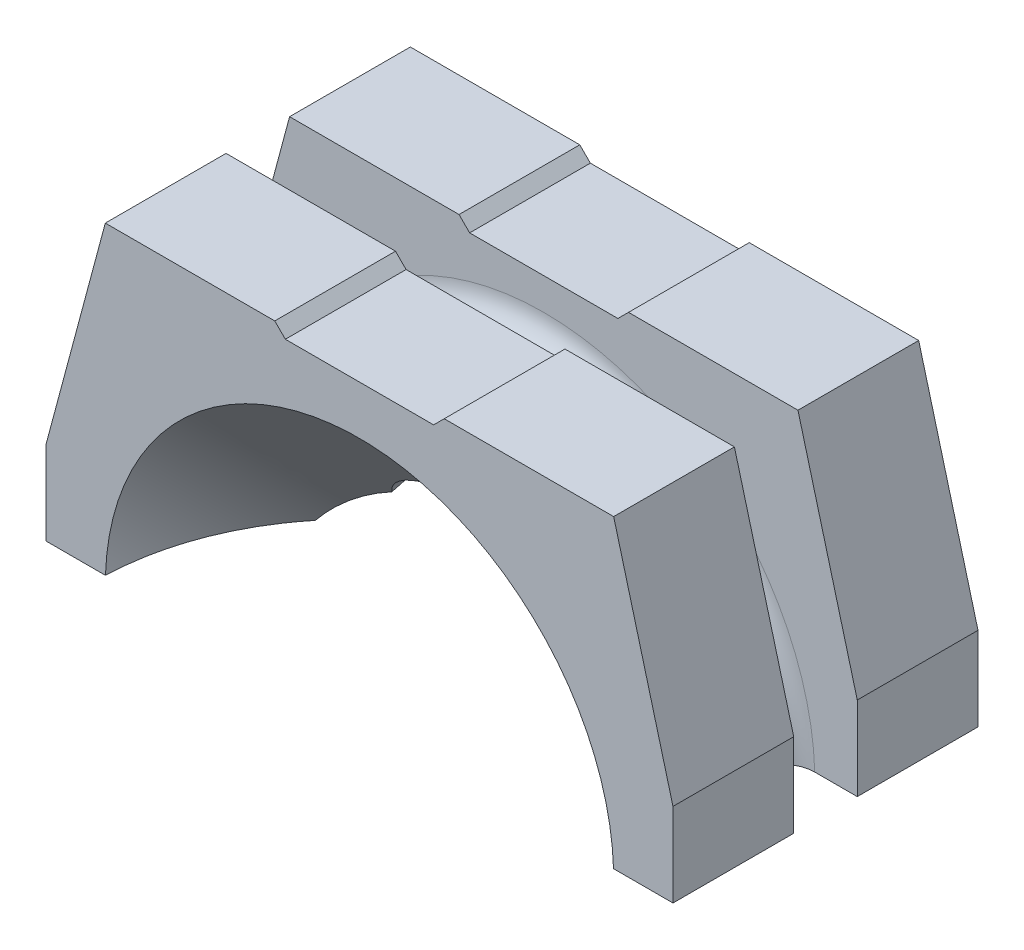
ISO-10303-21;
HEADER;
FILE_DESCRIPTION(('STEP AP214'),'2;1');
FILE_NAME('part.step','',(''),(''),'','','');
FILE_SCHEMA(('AUTOMOTIVE_DESIGN { 1 0 10303 214 1 1 1 1 }'));
ENDSEC;
DATA;
#1=APPLICATION_CONTEXT('core data for automotive mechanical design processes');
#2=APPLICATION_PROTOCOL_DEFINITION('international standard','automotive_design',2000,#1);
#3=PRODUCT_CONTEXT('',#1,'mechanical');
#4=PRODUCT('Part','Part','',(#3));
#5=PRODUCT_RELATED_PRODUCT_CATEGORY('part','',(#4));
#6=PRODUCT_DEFINITION_FORMATION('','',#4);
#7=PRODUCT_DEFINITION_CONTEXT('part definition',#1,'design');
#8=PRODUCT_DEFINITION('design','',#6,#7);
#9=PRODUCT_DEFINITION_SHAPE('','',#8);
#10=(LENGTH_UNIT() NAMED_UNIT(*) SI_UNIT(.MILLI.,.METRE.));
#11=(NAMED_UNIT(*) PLANE_ANGLE_UNIT() SI_UNIT($,.RADIAN.));
#12=(NAMED_UNIT(*) SI_UNIT($,.STERADIAN.) SOLID_ANGLE_UNIT());
#13=UNCERTAINTY_MEASURE_WITH_UNIT(LENGTH_MEASURE(1.E-05),#10,'distance_accuracy_value','');
#14=(GEOMETRIC_REPRESENTATION_CONTEXT(3) GLOBAL_UNCERTAINTY_ASSIGNED_CONTEXT((#13)) GLOBAL_UNIT_ASSIGNED_CONTEXT((#10,
#11,#12)) REPRESENTATION_CONTEXT('',''));
#15=CARTESIAN_POINT('',(0.,0.,0.));
#16=DIRECTION('',(0.,0.,1.));
#17=DIRECTION('',(1.,0.,0.));
#18=AXIS2_PLACEMENT_3D('',#15,#16,#17);
#19=CARTESIAN_POINT('',(-7.4,7.40000000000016,3.60000000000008));
#20=DIRECTION('',(0.,-1.00000000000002,0.));
#21=DIRECTION('',(0.,0.,-1.00000000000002));
#22=AXIS2_PLACEMENT_3D('',#19,#20,#21);
#23=PLANE('',#22);
#24=DIRECTION('',(-1.,0.,0.));
#25=VECTOR('',#24,1.);
#26=CARTESIAN_POINT('',(-7.4,7.40000000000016,-3.60000000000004));
#27=LINE('',#26,#25);
#28=CARTESIAN_POINT('',(6.,7.40000000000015,-3.60000000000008));
#29=VERTEX_POINT('',#28);
#30=CARTESIAN_POINT('',(2.,7.40000000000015,-3.60000000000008));
#31=VERTEX_POINT('',#30);
#32=EDGE_CURVE('E206',#29,#31,#27,.T.);
#33=ORIENTED_EDGE('',*,*,#32,.T.);
#34=DIRECTION('',(0.,0.,1.00000000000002));
#35=VECTOR('',#34,1.);
#36=CARTESIAN_POINT('',(2.,7.40000000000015,-3.60000000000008));
#37=LINE('',#36,#35);
#38=CARTESIAN_POINT('',(2.,7.40000000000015,-0.75));
#39=VERTEX_POINT('',#38);
#40=EDGE_CURVE('E188',#31,#39,#37,.T.);
#41=ORIENTED_EDGE('',*,*,#40,.T.);
#42=DIRECTION('',(-1.,0.,0.));
#43=VECTOR('',#42,1.);
#44=CARTESIAN_POINT('',(-7.4,7.40000000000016,-0.75));
#45=LINE('',#44,#43);
#46=CARTESIAN_POINT('',(6.,7.40000000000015,-0.750000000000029));
#47=VERTEX_POINT('',#46);
#48=EDGE_CURVE('E366',#47,#39,#45,.T.);
#49=ORIENTED_EDGE('',*,*,#48,.F.);
#50=DIRECTION('',(0.,0.,-1.00000000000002));
#51=VECTOR('',#50,1.);
#52=CARTESIAN_POINT('',(6.,7.40000000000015,3.60000000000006));
#53=LINE('',#52,#51);
#54=EDGE_CURVE('E212',#47,#29,#53,.T.);
#55=ORIENTED_EDGE('',*,*,#54,.T.);
#56=EDGE_LOOP('',(#33,#41,#49,#55));
#57=FACE_BOUND('',#56,.T.);
#58=ADVANCED_FACE('F14',(#57),#23,.F.);
#59=DIRECTION('',(1.,0.,0.));
#60=VECTOR('',#59,1.);
#61=CARTESIAN_POINT('',(-7.4,7.40000000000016,0.750000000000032));
#62=LINE('',#61,#60);
#63=CARTESIAN_POINT('',(2.,7.40000000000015,0.75));
#64=VERTEX_POINT('',#63);
#65=CARTESIAN_POINT('',(6.,7.40000000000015,0.75));
#66=VERTEX_POINT('',#65);
#67=EDGE_CURVE('E357',#64,#66,#62,.T.);
#68=ORIENTED_EDGE('',*,*,#67,.F.);
#69=DIRECTION('',(0.,0.,1.00000000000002));
#70=VECTOR('',#69,1.);
#71=CARTESIAN_POINT('',(2.,7.40000000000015,3.60000000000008));
#72=LINE('',#71,#70);
#73=CARTESIAN_POINT('',(2.,7.40000000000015,3.60000000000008));
#74=VERTEX_POINT('',#73);
#75=EDGE_CURVE('E9',#64,#74,#72,.T.);
#76=ORIENTED_EDGE('',*,*,#75,.T.);
#77=DIRECTION('',(-1.,0.,0.));
#78=VECTOR('',#77,1.);
#79=CARTESIAN_POINT('',(-7.4,7.40000000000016,3.60000000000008));
#80=LINE('',#79,#78);
#81=CARTESIAN_POINT('',(6.,7.40000000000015,3.60000000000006));
#82=VERTEX_POINT('',#81);
#83=EDGE_CURVE('E374',#82,#74,#80,.T.);
#84=ORIENTED_EDGE('',*,*,#83,.F.);
#85=DIRECTION('',(0.,0.,-1.00000000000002));
#86=VECTOR('',#85,1.);
#87=CARTESIAN_POINT('',(6.,7.40000000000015,3.60000000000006));
#88=LINE('',#87,#86);
#89=EDGE_CURVE('E247',#82,#66,#88,.T.);
#90=ORIENTED_EDGE('',*,*,#89,.T.);
#91=EDGE_LOOP('',(#68,#76,#84,#90));
#92=FACE_BOUND('',#91,.T.);
#93=ADVANCED_FACE('F473',(#92),#23,.F.);
#94=CARTESIAN_POINT('',(7.4,7.40000000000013,-3.60000000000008));
#95=DIRECTION('',(0.,0.,-1.00000000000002));
#96=DIRECTION('',(-1.,0.,0.));
#97=AXIS2_PLACEMENT_3D('',#94,#95,#96);
#98=PLANE('',#97);
#99=DIRECTION('',(0.707106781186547,0.707106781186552,0.));
#100=VECTOR('',#99,1.);
#101=CARTESIAN_POINT('',(2.,7.40000000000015,-3.60000000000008));
#102=LINE('',#101,#100);
#103=CARTESIAN_POINT('',(1.75,7.15000000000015,-3.60000000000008));
#104=VERTEX_POINT('',#103);
#105=EDGE_CURVE('E192',#104,#31,#102,.T.);
#106=ORIENTED_EDGE('',*,*,#105,.T.);
#107=ORIENTED_EDGE('',*,*,#32,.F.);
#108=DIRECTION('',(-0.258819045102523,0.965925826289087,0.));
#109=VECTOR('',#108,1.);
#110=CARTESIAN_POINT('',(6.09378221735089,7.05000000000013,-3.60000000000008));
#111=LINE('',#110,#109);
#112=CARTESIAN_POINT('',(7.4,2.17512886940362,-3.60000000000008));
#113=VERTEX_POINT('',#112);
#114=EDGE_CURVE('E226',#29,#113,#111,.F.);
#115=ORIENTED_EDGE('',*,*,#114,.T.);
#116=DIRECTION('',(0.,1.00000000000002,0.));
#117=VECTOR('',#116,1.);
#118=CARTESIAN_POINT('',(7.4,-7.40000000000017,-3.60000000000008));
#119=LINE('',#118,#117);
#120=CARTESIAN_POINT('',(7.4,0.199999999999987,-3.60000000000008));
#121=VERTEX_POINT('',#120);
#122=EDGE_CURVE('E219',#121,#113,#119,.T.);
#123=ORIENTED_EDGE('',*,*,#122,.F.);
#124=DIRECTION('',(-1.,0.,0.));
#125=VECTOR('',#124,1.);
#126=CARTESIAN_POINT('',(-7.4,0.200000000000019,-3.60000000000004));
#127=LINE('',#126,#125);
#128=CARTESIAN_POINT('',(5.99666574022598,0.19999999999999,-3.60000000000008));
#129=VERTEX_POINT('',#128);
#130=EDGE_CURVE('E304',#121,#129,#127,.T.);
#131=ORIENTED_EDGE('',*,*,#130,.T.);
#132=CARTESIAN_POINT('',(0.,0.,-3.60000000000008));
#133=DIRECTION('',(0.,0.,1.00000000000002));
#134=DIRECTION('',(1.,0.,0.));
#135=AXIS2_PLACEMENT_3D('',#132,#133,#134);
#136=CIRCLE('',#135,6.);
#137=CARTESIAN_POINT('',(-5.99666574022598,0.200000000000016,-3.60000000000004));
#138=VERTEX_POINT('',#137);
#139=EDGE_CURVE('E428',#129,#138,#136,.T.);
#140=ORIENTED_EDGE('',*,*,#139,.T.);
#141=CARTESIAN_POINT('',(-7.4,0.200000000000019,-3.60000000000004));
#142=VERTEX_POINT('',#141);
#143=EDGE_CURVE('E303',#138,#142,#127,.T.);
#144=ORIENTED_EDGE('',*,*,#143,.T.);
#145=DIRECTION('',(0.,-1.00000000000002,0.));
#146=VECTOR('',#145,1.);
#147=CARTESIAN_POINT('',(-7.4,-7.40000000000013,-3.60000000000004));
#148=LINE('',#147,#146);
#149=CARTESIAN_POINT('',(-7.4,2.17512886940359,-3.60000000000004));
#150=VERTEX_POINT('',#149);
#151=EDGE_CURVE('E213',#150,#142,#148,.T.);
#152=ORIENTED_EDGE('',*,*,#151,.F.);
#153=DIRECTION('',(-0.25881904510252,-0.965925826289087,0.));
#154=VECTOR('',#153,1.);
#155=CARTESIAN_POINT('',(-5.10237020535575,10.7500000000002,-3.60000000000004));
#156=LINE('',#155,#154);
#157=CARTESIAN_POINT('',(-6.,7.40000000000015,-3.60000000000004));
#158=VERTEX_POINT('',#157);
#159=EDGE_CURVE('E229',#150,#158,#156,.F.);
#160=ORIENTED_EDGE('',*,*,#159,.T.);
#161=CARTESIAN_POINT('',(-2.,7.40000000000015,-3.60000000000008));
#162=VERTEX_POINT('',#161);
#163=EDGE_CURVE('E214',#162,#158,#27,.T.);
#164=ORIENTED_EDGE('',*,*,#163,.F.);
#165=DIRECTION('',(0.707106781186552,-0.707106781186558,0.));
#166=VECTOR('',#165,1.);
#167=CARTESIAN_POINT('',(-2.,7.40000000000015,-3.60000000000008));
#168=LINE('',#167,#166);
#169=CARTESIAN_POINT('',(-1.75,7.15000000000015,-3.60000000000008));
#170=VERTEX_POINT('',#169);
#171=EDGE_CURVE('E29',#162,#170,#168,.T.);
#172=ORIENTED_EDGE('',*,*,#171,.T.);
#173=DIRECTION('',(1.,0.,0.));
#174=VECTOR('',#173,1.);
#175=CARTESIAN_POINT('',(1.75,7.15000000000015,-3.60000000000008));
#176=LINE('',#175,#174);
#177=EDGE_CURVE('E201',#170,#104,#176,.T.);
#178=ORIENTED_EDGE('',*,*,#177,.T.);
#179=EDGE_LOOP('',(#106,#107,#115,#123,#131,#140,#144,#152,#160,#164,#172,#178));
#180=FACE_BOUND('',#179,.T.);
#181=ADVANCED_FACE('F205',(#180),#98,.T.);
#182=CARTESIAN_POINT('',(-7.4,0.200000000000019,3.60000000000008));
#183=DIRECTION('',(0.,-1.00000000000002,0.));
#184=DIRECTION('',(0.,0.,-1.00000000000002));
#185=AXIS2_PLACEMENT_3D('',#182,#183,#184);
#186=PLANE('',#185);
#187=ORIENTED_EDGE('',*,*,#143,.F.);
#188=CARTESIAN_POINT('',(-5.99666574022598,0.200000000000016,-3.60000000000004));
#189=CARTESIAN_POINT('',(-5.99114041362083,0.200000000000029,-3.43381950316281));
#190=CARTESIAN_POINT('',(-5.97867393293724,0.200000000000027,-3.26787298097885));
#191=CARTESIAN_POINT('',(-5.94002024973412,0.200000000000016,-2.9375916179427));
#192=CARTESIAN_POINT('',(-5.91383356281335,0.200000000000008,-2.77325671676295));
#193=CARTESIAN_POINT('',(-5.84789970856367,0.200000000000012,-2.44732519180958));
#194=CARTESIAN_POINT('',(-5.80815216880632,0.200000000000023,-2.28572864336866));
#195=CARTESIAN_POINT('',(-5.7153774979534,0.20000000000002,-1.96639680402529));
#196=CARTESIAN_POINT('',(-5.6623505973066,0.200000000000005,-1.80866144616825));
#197=CARTESIAN_POINT('',(-5.54339421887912,0.200000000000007,-1.49817152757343));
#198=CARTESIAN_POINT('',(-5.47746746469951,0.200000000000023,-1.3454159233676));
#199=CARTESIAN_POINT('',(-5.3331282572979,0.200000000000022,-1.04583949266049));
#200=CARTESIAN_POINT('',(-5.25471033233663,0.200000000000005,-0.899021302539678));
#201=CARTESIAN_POINT('',(-5.08596969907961,0.200000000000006,-0.612437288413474));
#202=CARTESIAN_POINT('',(-4.99564967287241,0.200000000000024,-0.472669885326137));
#203=CARTESIAN_POINT('',(-4.80371652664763,0.200000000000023,-0.201117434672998));
#204=CARTESIAN_POINT('',(-4.70210328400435,0.200000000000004,-0.0693324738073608));
#205=CARTESIAN_POINT('',(-4.48828741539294,0.200000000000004,0.185336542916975));
#206=CARTESIAN_POINT('',(-4.37608581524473,0.200000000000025,0.30822145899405));
#207=CARTESIAN_POINT('',(-4.14187319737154,0.200000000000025,0.544255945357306));
#208=CARTESIAN_POINT('',(-4.01986039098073,0.200000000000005,0.657403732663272));
#209=CARTESIAN_POINT('',(-3.70538362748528,0.199999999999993,0.925572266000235));
#210=CARTESIAN_POINT('',(-3.5074493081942,0.200000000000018,1.07428906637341));
#211=CARTESIAN_POINT('',(-3.19794032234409,0.200000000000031,1.2782406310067));
#212=CARTESIAN_POINT('',(-3.09255812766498,0.200000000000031,1.34309225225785));
#213=CARTESIAN_POINT('',(-2.87800250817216,0.200000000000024,1.46615391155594));
#214=CARTESIAN_POINT('',(-2.76882957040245,0.200000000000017,1.52436479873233));
#215=CARTESIAN_POINT('',(-2.65792727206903,0.200000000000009,1.5791656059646));
#216=B_SPLINE_CURVE_WITH_KNOTS('',3,(#188,#189,#190,#191,#192,#193,#194,#195,#196,#197,#198,
#199,#200,#201,#202,#203,#204,#205,#206,#207,#208,#209,#210,#211,#212,#213,#214,#215),
.UNSPECIFIED.,.F.,.F.,(4,2,2,2,2,2,2,2,2,2,2,2,2,4),(0.,0.498669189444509,0.997319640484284,
1.49598378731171,1.99463928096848,2.49318960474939,2.99195892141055,3.49061603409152,
3.98927856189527,4.48789282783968,4.98659820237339,5.72715468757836,6.09817285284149,
6.46914352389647),.UNSPECIFIED.);
#217=CARTESIAN_POINT('',(-4.64327470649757,0.200000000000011,0.));
#218=VERTEX_POINT('',#217);
#219=EDGE_CURVE('E295',#138,#218,#216,.T.);
#220=ORIENTED_EDGE('',*,*,#219,.T.);
#221=CARTESIAN_POINT('',(-5.996665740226,0.200000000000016,3.60000000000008));
#222=CARTESIAN_POINT('',(-5.99114041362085,0.200000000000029,3.43381950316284));
#223=CARTESIAN_POINT('',(-5.97867393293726,0.200000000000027,3.26787298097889));
#224=CARTESIAN_POINT('',(-5.94002024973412,0.200000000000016,2.93759161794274));
#225=CARTESIAN_POINT('',(-5.91383356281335,0.200000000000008,2.773256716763));
#226=CARTESIAN_POINT('',(-5.84789970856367,0.200000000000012,2.44732519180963));
#227=CARTESIAN_POINT('',(-5.80815216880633,0.200000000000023,2.28572864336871));
#228=CARTESIAN_POINT('',(-5.71537749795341,0.20000000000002,1.96639680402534));
#229=CARTESIAN_POINT('',(-5.6623505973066,0.200000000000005,1.8086614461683));
#230=CARTESIAN_POINT('',(-5.54339421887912,0.200000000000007,1.49817152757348));
#231=CARTESIAN_POINT('',(-5.47746746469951,0.200000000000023,1.34541592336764));
#232=CARTESIAN_POINT('',(-5.33312825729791,0.200000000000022,1.04583949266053));
#233=CARTESIAN_POINT('',(-5.25471033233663,0.200000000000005,0.899021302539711));
#234=CARTESIAN_POINT('',(-5.08596969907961,0.200000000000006,0.612437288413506));
#235=CARTESIAN_POINT('',(-4.9956496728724,0.200000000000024,0.47266988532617));
#236=CARTESIAN_POINT('',(-4.80371652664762,0.200000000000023,0.20111743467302));
#237=CARTESIAN_POINT('',(-4.70210328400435,0.200000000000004,0.0693324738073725));
#238=CARTESIAN_POINT('',(-4.48828741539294,0.200000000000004,-0.185336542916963));
#239=CARTESIAN_POINT('',(-4.37608581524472,0.200000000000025,-0.308221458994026));
#240=CARTESIAN_POINT('',(-4.14187319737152,0.200000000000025,-0.544255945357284));
#241=CARTESIAN_POINT('',(-4.01986039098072,0.200000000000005,-0.657403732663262));
#242=CARTESIAN_POINT('',(-3.70538362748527,0.199999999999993,-0.925572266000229));
#243=CARTESIAN_POINT('',(-3.50744930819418,0.200000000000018,-1.07428906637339));
#244=CARTESIAN_POINT('',(-3.19794032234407,0.200000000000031,-1.27824063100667));
#245=CARTESIAN_POINT('',(-3.09255812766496,0.200000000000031,-1.34309225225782));
#246=CARTESIAN_POINT('',(-2.87800250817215,0.200000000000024,-1.46615391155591));
#247=CARTESIAN_POINT('',(-2.76882957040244,0.200000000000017,-1.5243647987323));
#248=CARTESIAN_POINT('',(-2.65792727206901,0.200000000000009,-1.57916560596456));
#249=B_SPLINE_CURVE_WITH_KNOTS('',3,(#221,#222,#223,#224,#225,#226,#227,#228,#229,#230,#231,
#232,#233,#234,#235,#236,#237,#238,#239,#240,#241,#242,#243,#244,#245,#246,#247,#248),
.UNSPECIFIED.,.F.,.F.,(4,2,2,2,2,2,2,2,2,2,2,2,2,4),(0.,0.4986691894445,0.997319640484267,
1.4959837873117,1.99463928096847,2.49318960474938,2.99195892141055,3.49061603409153,
3.98927856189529,4.4878928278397,4.98659820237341,5.72715468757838,6.09817285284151,
6.46914352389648),.UNSPECIFIED.);
#250=CARTESIAN_POINT('',(-5.996665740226,0.200000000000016,3.60000000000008));
#251=VERTEX_POINT('',#250);
#252=EDGE_CURVE('E269',#251,#218,#249,.T.);
#253=ORIENTED_EDGE('',*,*,#252,.F.);
#254=DIRECTION('',(-1.,0.,0.));
#255=VECTOR('',#254,1.);
#256=CARTESIAN_POINT('',(-7.4,0.200000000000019,3.60000000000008));
#257=LINE('',#256,#255);
#258=CARTESIAN_POINT('',(-7.4,0.200000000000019,3.60000000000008));
#259=VERTEX_POINT('',#258);
#260=EDGE_CURVE('E307',#251,#259,#257,.T.);
#261=ORIENTED_EDGE('',*,*,#260,.T.);
#262=DIRECTION('',(0.,0.,-1.00000000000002));
#263=VECTOR('',#262,1.);
#264=CARTESIAN_POINT('',(-7.4,0.200000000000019,3.60000000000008));
#265=LINE('',#264,#263);
#266=CARTESIAN_POINT('',(-7.4,0.200000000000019,0.750000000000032));
#267=VERTEX_POINT('',#266);
#268=EDGE_CURVE('E312',#259,#267,#265,.T.);
#269=ORIENTED_EDGE('',*,*,#268,.T.);
#270=DIRECTION('',(-1.,0.,0.));
#271=VECTOR('',#270,1.);
#272=CARTESIAN_POINT('',(0.,0.2,0.75));
#273=LINE('',#272,#271);
#274=CARTESIAN_POINT('',(-6.39687423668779,0.200000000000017,0.750000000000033));
#275=VERTEX_POINT('',#274);
#276=EDGE_CURVE('E345',#275,#267,#273,.T.);
#277=ORIENTED_EDGE('',*,*,#276,.F.);
#278=CARTESIAN_POINT('',(-6.0483171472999,0.200000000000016,-0.664178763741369));
#279=CARTESIAN_POINT('',(-6.01099134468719,0.200000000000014,-0.644609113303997));
#280=CARTESIAN_POINT('',(-5.97529040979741,0.200000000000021,-0.621874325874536));
#281=CARTESIAN_POINT('',(-5.90818226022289,0.200000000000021,-0.570714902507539));
#282=CARTESIAN_POINT('',(-5.8767802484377,0.200000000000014,-0.542283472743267));
#283=CARTESIAN_POINT('',(-5.81920842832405,0.200000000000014,-0.480560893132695));
#284=CARTESIAN_POINT('',(-5.79303625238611,0.200000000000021,-0.447271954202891));
#285=CARTESIAN_POINT('',(-5.74666240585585,0.200000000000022,-0.376779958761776));
#286=CARTESIAN_POINT('',(-5.72645924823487,0.200000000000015,-0.339577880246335));
#287=CARTESIAN_POINT('',(-5.69259435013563,0.200000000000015,-0.262320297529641));
#288=CARTESIAN_POINT('',(-5.67893059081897,0.200000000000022,-0.222265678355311));
#289=CARTESIAN_POINT('',(-5.65852482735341,0.200000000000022,-0.14042888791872));
#290=CARTESIAN_POINT('',(-5.65178307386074,0.200000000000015,-0.0986466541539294));
#291=CARTESIAN_POINT('',(-5.64541610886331,0.200000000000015,-0.0145646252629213));
#292=CARTESIAN_POINT('',(-5.64578732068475,0.200000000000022,0.0277348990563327));
#293=CARTESIAN_POINT('',(-5.65362692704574,0.200000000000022,0.11167093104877));
#294=CARTESIAN_POINT('',(-5.66109529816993,0.200000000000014,0.153307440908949));
#295=CARTESIAN_POINT('',(-5.68291498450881,0.200000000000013,0.234730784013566));
#296=CARTESIAN_POINT('',(-5.69726549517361,0.200000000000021,0.274517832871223));
#297=CARTESIAN_POINT('',(-5.7324404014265,0.200000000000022,0.351119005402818));
#298=CARTESIAN_POINT('',(-5.75326479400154,0.200000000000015,0.387933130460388));
#299=CARTESIAN_POINT('',(-5.8008027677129,0.200000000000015,0.457556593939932));
#300=CARTESIAN_POINT('',(-5.82751823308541,0.200000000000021,0.490364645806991));
#301=CARTESIAN_POINT('',(-5.88607517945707,0.200000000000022,0.55103315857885));
#302=CARTESIAN_POINT('',(-5.91791668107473,0.200000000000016,0.578893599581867));
#303=CARTESIAN_POINT('',(-5.98584099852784,0.200000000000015,0.628892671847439));
#304=CARTESIAN_POINT('',(-6.02192619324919,0.200000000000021,0.651028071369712));
#305=CARTESIAN_POINT('',(-6.09729920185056,0.200000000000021,0.688930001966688));
#306=CARTESIAN_POINT('',(-6.13658702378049,0.200000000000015,0.704696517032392));
#307=CARTESIAN_POINT('',(-6.21727099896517,0.200000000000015,0.729420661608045));
#308=CARTESIAN_POINT('',(-6.25866818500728,0.20000000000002,0.738374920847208));
#309=CARTESIAN_POINT('',(-6.34237824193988,0.200000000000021,0.749207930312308));
#310=CARTESIAN_POINT('',(-6.38469111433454,0.200000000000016,0.751086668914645));
#311=CARTESIAN_POINT('',(-6.46904040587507,0.200000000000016,0.747714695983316));
#312=CARTESIAN_POINT('',(-6.51107676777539,0.20000000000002,0.742462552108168));
#313=CARTESIAN_POINT('',(-6.59367085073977,0.20000000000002,0.724974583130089));
#314=CARTESIAN_POINT('',(-6.63422857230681,0.200000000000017,0.712738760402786));
#315=CARTESIAN_POINT('',(-6.71270804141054,0.200000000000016,0.681631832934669));
#316=CARTESIAN_POINT('',(-6.7506301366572,0.200000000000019,0.66276160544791));
#317=CARTESIAN_POINT('',(-6.82276648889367,0.20000000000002,0.61892021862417));
#318=CARTESIAN_POINT('',(-6.8569807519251,0.200000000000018,0.593949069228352));
#319=CARTESIAN_POINT('',(-6.92071695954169,0.200000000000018,0.538624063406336));
#320=CARTESIAN_POINT('',(-6.95024057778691,0.200000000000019,0.508272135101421));
#321=CARTESIAN_POINT('',(-7.00377052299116,0.200000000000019,0.443040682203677));
#322=CARTESIAN_POINT('',(-7.02777686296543,0.200000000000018,0.408161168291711));
#323=CARTESIAN_POINT('',(-7.06958028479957,0.200000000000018,0.33488032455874));
#324=CARTESIAN_POINT('',(-7.08737995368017,0.200000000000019,0.296480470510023));
#325=CARTESIAN_POINT('',(-7.11627747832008,0.200000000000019,0.217236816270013));
#326=CARTESIAN_POINT('',(-7.12737534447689,0.200000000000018,0.176393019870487));
#327=CARTESIAN_POINT('',(-7.14255090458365,0.200000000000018,0.093435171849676));
#328=CARTESIAN_POINT('',(-7.14663087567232,0.200000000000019,0.0513215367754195));
#329=CARTESIAN_POINT('',(-7.14766159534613,0.200000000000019,-0.0329928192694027));
#330=CARTESIAN_POINT('',(-7.14461235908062,0.200000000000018,-0.0751935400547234));
#331=CARTESIAN_POINT('',(-7.13147233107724,0.200000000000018,-0.158478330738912));
#332=CARTESIAN_POINT('',(-7.12138246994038,0.200000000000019,-0.19956254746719));
#333=CARTESIAN_POINT('',(-7.09444914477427,0.200000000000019,-0.279454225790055));
#334=CARTESIAN_POINT('',(-7.07760566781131,0.200000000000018,-0.318261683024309));
#335=CARTESIAN_POINT('',(-7.03764204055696,0.200000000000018,-0.392502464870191));
#336=CARTESIAN_POINT('',(-7.01452128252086,0.20000000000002,-0.427935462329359));
#337=CARTESIAN_POINT('',(-6.96266085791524,0.200000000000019,-0.494418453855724));
#338=CARTESIAN_POINT('',(-6.93392117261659,0.200000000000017,-0.52546843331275));
#339=CARTESIAN_POINT('',(-6.87162919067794,0.200000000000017,-0.582314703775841));
#340=CARTESIAN_POINT('',(-6.83807535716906,0.20000000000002,-0.608109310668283));
#341=CARTESIAN_POINT('',(-6.76711612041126,0.200000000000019,-0.653700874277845));
#342=CARTESIAN_POINT('',(-6.72971086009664,0.200000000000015,-0.673498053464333));
#343=CARTESIAN_POINT('',(-6.65209742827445,0.200000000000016,-0.706541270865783));
#344=CARTESIAN_POINT('',(-6.61188839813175,0.20000000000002,-0.719785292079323));
#345=CARTESIAN_POINT('',(-6.52980684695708,0.20000000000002,-0.739340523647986));
#346=CARTESIAN_POINT('',(-6.48793391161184,0.200000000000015,-0.745649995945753));
#347=CARTESIAN_POINT('',(-6.40369093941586,0.200000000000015,-0.751156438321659));
#348=CARTESIAN_POINT('',(-6.36132050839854,0.200000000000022,-0.750347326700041));
#349=CARTESIAN_POINT('',(-6.27735300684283,0.20000000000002,-0.741623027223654));
#350=CARTESIAN_POINT('',(-6.23575506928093,0.200000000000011,-0.733716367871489));
#351=CARTESIAN_POINT('',(-6.16973239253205,0.200000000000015,-0.715301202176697));
#352=CARTESIAN_POINT('',(-6.14470768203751,0.200000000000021,-0.706874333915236));
#353=CARTESIAN_POINT('',(-6.09568214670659,0.200000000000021,-0.687437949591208));
#354=CARTESIAN_POINT('',(-6.07168132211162,0.200000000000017,-0.676428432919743));
#355=CARTESIAN_POINT('',(-6.0483171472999,0.200000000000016,-0.664178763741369));
#356=B_SPLINE_CURVE_WITH_KNOTS('',3,(#278,#279,#280,#281,#282,#283,#284,#285,#286,#287,#288,
#289,#290,#291,#292,#293,#294,#295,#296,#297,#298,#299,#300,#301,#302,#303,#304,#305,#306,#307,
#308,#309,#310,#311,#312,#313,#314,#315,#316,#317,#318,#319,#320,#321,#322,#323,#324,#325,#326,
#327,#328,#329,#330,#331,#332,#333,#334,#335,#336,#337,#338,#339,#340,#341,#342,#343,#344,#345,
#346,#347,#348,#349,#350,#351,#352,#353,#354,#355),.UNSPECIFIED.,.T.,.F.,(4,2,2,2,2,2,2,2,2,2,2,
2,2,2,2,2,2,2,2,2,2,2,2,2,2,2,2,2,2,2,2,2,2,2,2,2,2,2,4),(0.,0.126338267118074,
0.252828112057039,0.379260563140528,0.505661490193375,0.632023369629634,0.758389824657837,
0.884692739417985,1.01099523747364,1.13728297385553,1.26357065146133,1.38989878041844,
1.51622741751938,1.6426272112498,1.76902732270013,1.89548992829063,2.02195274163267,
2.14844096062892,2.27492913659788,2.40140059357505,2.52787184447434,2.65429786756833,
2.78072359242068,2.90709655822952,3.0334693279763,3.15980108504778,3.28613257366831,
3.41244736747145,3.53876240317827,3.66508967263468,3.79141736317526,3.91778547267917,
4.04414889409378,4.17055118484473,4.29698514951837,4.42352714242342,4.549917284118,
4.62899900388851,4.70808074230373),.UNSPECIFIED.);
#357=CARTESIAN_POINT('',(-6.39687423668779,0.200000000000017,-0.750000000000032));
#358=VERTEX_POINT('',#357);
#359=EDGE_CURVE('E339',#358,#275,#356,.T.);
#360=ORIENTED_EDGE('',*,*,#359,.F.);
#361=DIRECTION('',(1.,0.,0.));
#362=VECTOR('',#361,1.);
#363=CARTESIAN_POINT('',(0.,0.200000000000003,-0.75));
#364=LINE('',#363,#362);
#365=CARTESIAN_POINT('',(-7.4,0.200000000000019,-0.75));
#366=VERTEX_POINT('',#365);
#367=EDGE_CURVE('E351',#366,#358,#364,.T.);
#368=ORIENTED_EDGE('',*,*,#367,.F.);
#369=EDGE_CURVE('E311',#366,#142,#265,.T.);
#370=ORIENTED_EDGE('',*,*,#369,.T.);
#371=EDGE_LOOP('',(#187,#220,#253,#261,#269,#277,#360,#368,#370));
#372=FACE_BOUND('',#371,.T.);
#373=ADVANCED_FACE('F275',(#372),#186,.T.);
#374=CARTESIAN_POINT('',(2.65792727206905,0.199999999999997,-1.57916560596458));
#375=CARTESIAN_POINT('',(2.80700257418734,0.200000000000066,-1.50552430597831));
#376=CARTESIAN_POINT('',(2.95299906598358,0.20000000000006,-1.42565763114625));
#377=CARTESIAN_POINT('',(3.23785943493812,0.200000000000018,-1.25409290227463));
#378=CARTESIAN_POINT('',(3.37672357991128,0.199999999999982,-1.16239529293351));
#379=CARTESIAN_POINT('',(3.64635931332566,0.199999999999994,-0.96777976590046));
#380=CARTESIAN_POINT('',(3.77713067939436,0.200000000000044,-0.864861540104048));
#381=CARTESIAN_POINT('',(4.02967401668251,0.200000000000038,-0.648524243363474));
#382=CARTESIAN_POINT('',(4.1514461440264,0.199999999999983,-0.535105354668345));
#383=CARTESIAN_POINT('',(4.3851269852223,0.199999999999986,-0.298572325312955));
#384=CARTESIAN_POINT('',(4.49703777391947,0.200000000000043,-0.175460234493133));
#385=CARTESIAN_POINT('',(4.71029916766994,0.200000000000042,0.0796856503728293));
#386=CARTESIAN_POINT('',(4.81164511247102,0.199999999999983,0.211723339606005));
#387=CARTESIAN_POINT('',(5.00299875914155,0.199999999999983,0.483729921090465));
#388=CARTESIAN_POINT('',(5.09300900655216,0.200000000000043,0.623697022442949));
#389=CARTESIAN_POINT('',(5.26109676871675,0.200000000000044,0.910621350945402));
#390=CARTESIAN_POINT('',(5.33917415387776,0.199999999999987,1.05757865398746));
#391=CARTESIAN_POINT('',(5.48285011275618,0.199999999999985,1.35746321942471));
#392=CARTESIAN_POINT('',(5.5484498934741,0.20000000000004,1.51038990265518));
#393=CARTESIAN_POINT('',(5.66673265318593,0.200000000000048,1.82115833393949));
#394=CARTESIAN_POINT('',(5.7194132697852,0.200000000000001,1.97900097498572));
#395=CARTESIAN_POINT('',(5.83382592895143,0.199999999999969,2.37614042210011));
#396=CARTESIAN_POINT('',(5.88755788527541,0.200000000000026,2.61781697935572));
#397=CARTESIAN_POINT('',(5.94553299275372,0.200000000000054,2.98391934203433));
#398=CARTESIAN_POINT('',(5.96109174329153,0.200000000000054,3.10667546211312));
#399=CARTESIAN_POINT('',(5.98459488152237,0.200000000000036,3.35289871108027));
#400=CARTESIAN_POINT('',(5.99254024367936,0.200000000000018,3.47636574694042));
#401=CARTESIAN_POINT('',(5.99666574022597,0.199999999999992,3.60000000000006));
#402=B_SPLINE_CURVE_WITH_KNOTS('',3,(#374,#375,#376,#377,#378,#379,#380,#381,#382,#383,#384,
#385,#386,#387,#388,#389,#390,#391,#392,#393,#394,#395,#396,#397,#398,#399,#400,#401),
.UNSPECIFIED.,.F.,.F.,(4,2,2,2,2,2,2,2,2,2,2,2,2,4),(0.,0.498669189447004,0.99731964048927,
1.49598378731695,1.99463928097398,2.49318960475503,2.99195892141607,3.49061603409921,
3.98927856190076,4.48789282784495,4.98659820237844,5.72715468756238,6.09817285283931,
6.46914352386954),.UNSPECIFIED.);
#403=CARTESIAN_POINT('',(4.64327470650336,0.199999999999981,7.05468669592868E-12));
#404=VERTEX_POINT('',#403);
#405=CARTESIAN_POINT('',(5.99666574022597,0.19999999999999,3.60000000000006));
#406=VERTEX_POINT('',#405);
#407=EDGE_CURVE('E261',#404,#406,#402,.T.);
#408=ORIENTED_EDGE('',*,*,#407,.F.);
#409=CARTESIAN_POINT('',(2.65792727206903,0.199999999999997,1.57916560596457));
#410=CARTESIAN_POINT('',(2.80700257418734,0.200000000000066,1.50552430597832));
#411=CARTESIAN_POINT('',(2.95299906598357,0.20000000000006,1.42565763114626));
#412=CARTESIAN_POINT('',(3.2378594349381,0.200000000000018,1.25409290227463));
#413=CARTESIAN_POINT('',(3.37672357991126,0.199999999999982,1.1623952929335));
#414=CARTESIAN_POINT('',(3.64635931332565,0.199999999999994,0.967779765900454));
#415=CARTESIAN_POINT('',(3.77713067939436,0.200000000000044,0.86486154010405));
#416=CARTESIAN_POINT('',(4.02967401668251,0.200000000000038,0.648524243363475));
#417=CARTESIAN_POINT('',(4.1514461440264,0.199999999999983,0.535105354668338));
#418=CARTESIAN_POINT('',(4.3851269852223,0.199999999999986,0.298572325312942));
#419=CARTESIAN_POINT('',(4.49703777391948,0.200000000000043,0.175460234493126));
#420=CARTESIAN_POINT('',(4.71029916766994,0.200000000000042,-0.0796856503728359));
#421=CARTESIAN_POINT('',(4.81164511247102,0.199999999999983,-0.211723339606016));
#422=CARTESIAN_POINT('',(5.00299875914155,0.199999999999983,-0.483729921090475));
#423=CARTESIAN_POINT('',(5.09300900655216,0.200000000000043,-0.623697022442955));
#424=CARTESIAN_POINT('',(5.26109676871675,0.200000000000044,-0.910621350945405));
#425=CARTESIAN_POINT('',(5.33917415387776,0.199999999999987,-1.05757865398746));
#426=CARTESIAN_POINT('',(5.48285011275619,0.199999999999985,-1.35746321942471));
#427=CARTESIAN_POINT('',(5.54844989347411,0.20000000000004,-1.51038990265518));
#428=CARTESIAN_POINT('',(5.66673265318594,0.200000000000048,-1.82115833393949));
#429=CARTESIAN_POINT('',(5.7194132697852,0.200000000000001,-1.97900097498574));
#430=CARTESIAN_POINT('',(5.83382592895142,0.199999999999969,-2.37614042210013));
#431=CARTESIAN_POINT('',(5.88755788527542,0.200000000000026,-2.61781697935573));
#432=CARTESIAN_POINT('',(5.94553299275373,0.200000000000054,-2.98391934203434));
#433=CARTESIAN_POINT('',(5.96109174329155,0.200000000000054,-3.10667546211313));
#434=CARTESIAN_POINT('',(5.98459488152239,0.200000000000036,-3.35289871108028));
#435=CARTESIAN_POINT('',(5.99254024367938,0.200000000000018,-3.47636574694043));
#436=CARTESIAN_POINT('',(5.99666574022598,0.199999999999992,-3.60000000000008));
#437=B_SPLINE_CURVE_WITH_KNOTS('',3,(#409,#410,#411,#412,#413,#414,#415,#416,#417,#418,#419,
#420,#421,#422,#423,#424,#425,#426,#427,#428,#429,#430,#431,#432,#433,#434,#435,#436),
.UNSPECIFIED.,.F.,.F.,(4,2,2,2,2,2,2,2,2,2,2,2,2,4),(0.,0.498669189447,0.997319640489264,
1.49598378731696,1.994639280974,2.49318960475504,2.99195892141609,3.49061603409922,
3.98927856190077,4.48789282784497,4.98659820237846,5.7271546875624,6.09817285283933,
6.46914352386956),.UNSPECIFIED.);
#438=EDGE_CURVE('E731',#404,#129,#437,.T.);
#439=ORIENTED_EDGE('',*,*,#438,.T.);
#440=ORIENTED_EDGE('',*,*,#130,.F.);
#441=DIRECTION('',(0.,0.,-1.00000000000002));
#442=VECTOR('',#441,1.);
#443=CARTESIAN_POINT('',(7.4,0.199999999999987,3.60000000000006));
#444=LINE('',#443,#442);
#445=CARTESIAN_POINT('',(7.4,0.199999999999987,-0.750000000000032));
#446=VERTEX_POINT('',#445);
#447=EDGE_CURVE('E314',#446,#121,#444,.T.);
#448=ORIENTED_EDGE('',*,*,#447,.F.);
#449=CARTESIAN_POINT('',(6.39687423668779,0.19999999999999,-0.75000000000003));
#450=VERTEX_POINT('',#449);
#451=EDGE_CURVE('E346',#450,#446,#364,.T.);
#452=ORIENTED_EDGE('',*,*,#451,.F.);
#453=CARTESIAN_POINT('',(5.69451779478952,0.199999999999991,-0.264076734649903));
#454=CARTESIAN_POINT('',(5.70936164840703,0.199999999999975,-0.303505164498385));
#455=CARTESIAN_POINT('',(5.72754749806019,0.20000000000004,-0.3417083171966));
#456=CARTESIAN_POINT('',(5.77009186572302,0.200000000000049,-0.414549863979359));
#457=CARTESIAN_POINT('',(5.79445782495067,0.199999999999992,-0.449183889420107));
#458=CARTESIAN_POINT('',(5.84864877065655,0.19999999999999,-0.513854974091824));
#459=CARTESIAN_POINT('',(5.87847101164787,0.200000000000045,-0.543894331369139));
#460=CARTESIAN_POINT('',(5.9427254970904,0.200000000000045,-0.598533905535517));
#461=CARTESIAN_POINT('',(5.97715659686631,0.199999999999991,-0.623135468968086));
#462=CARTESIAN_POINT('',(6.0496768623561,0.199999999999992,-0.666225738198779));
#463=CARTESIAN_POINT('',(6.08776792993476,0.200000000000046,-0.68471124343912));
#464=CARTESIAN_POINT('',(6.16651345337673,0.200000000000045,-0.715028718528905));
#465=CARTESIAN_POINT('',(6.20716801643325,0.199999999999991,-0.726860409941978));
#466=CARTESIAN_POINT('',(6.28990289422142,0.199999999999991,-0.74353763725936));
#467=CARTESIAN_POINT('',(6.33198378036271,0.200000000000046,-0.74838033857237));
#468=CARTESIAN_POINT('',(6.41636129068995,0.200000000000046,-0.750933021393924));
#469=CARTESIAN_POINT('',(6.45865791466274,0.19999999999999,-0.748643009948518));
#470=CARTESIAN_POINT('',(6.542270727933,0.199999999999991,-0.736994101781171));
#471=CARTESIAN_POINT('',(6.58358681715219,0.200000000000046,-0.727634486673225));
#472=CARTESIAN_POINT('',(6.66406059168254,0.200000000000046,-0.702110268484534));
#473=CARTESIAN_POINT('',(6.70321828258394,0.19999999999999,-0.685945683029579));
#474=CARTESIAN_POINT('',(6.77825456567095,0.199999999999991,-0.64727355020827));
#475=CARTESIAN_POINT('',(6.8141338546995,0.200000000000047,-0.624767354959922));
#476=CARTESIAN_POINT('',(6.88160280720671,0.200000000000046,-0.574048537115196));
#477=CARTESIAN_POINT('',(6.91319247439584,0.199999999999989,-0.54583591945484));
#478=CARTESIAN_POINT('',(6.9711720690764,0.19999999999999,-0.484516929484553));
#479=CARTESIAN_POINT('',(6.997564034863,0.200000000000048,-0.451412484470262));
#480=CARTESIAN_POINT('',(7.04441292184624,0.200000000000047,-0.381241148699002));
#481=CARTESIAN_POINT('',(7.06486985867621,0.199999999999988,-0.34417426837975));
#482=CARTESIAN_POINT('',(7.09925947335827,0.199999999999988,-0.267146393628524));
#483=CARTESIAN_POINT('',(7.11319478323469,0.200000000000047,-0.227186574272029));
#484=CARTESIAN_POINT('',(7.13415684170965,0.200000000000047,-0.145494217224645));
#485=CARTESIAN_POINT('',(7.14118360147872,0.199999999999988,-0.103761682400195));
#486=CARTESIAN_POINT('',(7.14812761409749,0.199999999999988,-0.0197209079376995));
#487=CARTESIAN_POINT('',(7.14804683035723,0.200000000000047,0.0225871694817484));
#488=CARTESIAN_POINT('',(7.14078296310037,0.200000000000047,0.106589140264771));
#489=CARTESIAN_POINT('',(7.13359988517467,0.199999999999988,0.148283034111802));
#490=CARTESIAN_POINT('',(7.11233648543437,0.199999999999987,0.229870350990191));
#491=CARTESIAN_POINT('',(7.0982566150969,0.200000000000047,0.269763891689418));
#492=CARTESIAN_POINT('',(7.0636002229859,0.200000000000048,0.346621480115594));
#493=CARTESIAN_POINT('',(7.04302369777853,0.19999999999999,0.383585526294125));
#494=CARTESIAN_POINT('',(6.99595495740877,0.199999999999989,0.453541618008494));
#495=CARTESIAN_POINT('',(6.96946177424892,0.200000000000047,0.48653301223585));
#496=CARTESIAN_POINT('',(6.91131440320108,0.200000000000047,0.547601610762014));
#497=CARTESIAN_POINT('',(6.87966020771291,0.199999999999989,0.57567880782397));
#498=CARTESIAN_POINT('',(6.81207783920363,0.199999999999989,0.626132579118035));
#499=CARTESIAN_POINT('',(6.77614819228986,0.200000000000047,0.64850717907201));
#500=CARTESIAN_POINT('',(6.7010436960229,0.200000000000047,0.686909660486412));
#501=CARTESIAN_POINT('',(6.66186883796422,0.199999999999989,0.702937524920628));
#502=CARTESIAN_POINT('',(6.58136840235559,0.199999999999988,0.728198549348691));
#503=CARTESIAN_POINT('',(6.54004193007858,0.200000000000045,0.737428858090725));
#504=CARTESIAN_POINT('',(6.45642608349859,0.200000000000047,0.748822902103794));
#505=CARTESIAN_POINT('',(6.41413670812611,0.199999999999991,0.750986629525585));
#506=CARTESIAN_POINT('',(6.32978040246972,0.19999999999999,0.748186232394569));
#507=CARTESIAN_POINT('',(6.28771355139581,0.200000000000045,0.743219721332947));
#508=CARTESIAN_POINT('',(6.20501040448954,0.200000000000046,0.726295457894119));
#509=CARTESIAN_POINT('',(6.16437411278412,0.199999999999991,0.71433768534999));
#510=CARTESIAN_POINT('',(6.08568233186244,0.199999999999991,0.683768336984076));
#511=CARTESIAN_POINT('',(6.04762706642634,0.200000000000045,0.665156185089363));
#512=CARTESIAN_POINT('',(5.97518232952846,0.200000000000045,0.62180556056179));
#513=CARTESIAN_POINT('',(5.94079286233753,0.199999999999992,0.597067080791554));
#514=CARTESIAN_POINT('',(5.87666520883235,0.199999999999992,0.542171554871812));
#515=CARTESIAN_POINT('',(5.84692594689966,0.200000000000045,0.512015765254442));
#516=CARTESIAN_POINT('',(5.79293665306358,0.200000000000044,0.447138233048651));
#517=CARTESIAN_POINT('',(5.76868639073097,0.19999999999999,0.412416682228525));
#518=CARTESIAN_POINT('',(5.72637782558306,0.199999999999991,0.339415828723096));
#519=CARTESIAN_POINT('',(5.70831564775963,0.200000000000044,0.301138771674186));
#520=CARTESIAN_POINT('',(5.67887366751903,0.200000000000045,0.222083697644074));
#521=CARTESIAN_POINT('',(5.66749550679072,0.199999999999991,0.181305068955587));
#522=CARTESIAN_POINT('',(5.65175244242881,0.199999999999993,0.0984227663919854));
#523=CARTESIAN_POINT('',(5.64738704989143,0.200000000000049,0.0563191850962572));
#524=CARTESIAN_POINT('',(5.64579883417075,0.20000000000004,-0.0279875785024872));
#525=CARTESIAN_POINT('',(5.64856739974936,0.199999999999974,-0.0701905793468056));
#526=CARTESIAN_POINT('',(5.65876833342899,0.200000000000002,-0.137816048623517));
#527=CARTESIAN_POINT('',(5.66405553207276,0.200000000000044,-0.163581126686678));
#528=CARTESIAN_POINT('',(5.67730104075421,0.200000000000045,-0.214415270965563));
#529=CARTESIAN_POINT('',(5.68525934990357,0.200000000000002,-0.239484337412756));
#530=CARTESIAN_POINT('',(5.69451779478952,0.199999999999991,-0.264076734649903));
#531=B_SPLINE_CURVE_WITH_KNOTS('',3,(#453,#454,#455,#456,#457,#458,#459,#460,#461,#462,#463,
#464,#465,#466,#467,#468,#469,#470,#471,#472,#473,#474,#475,#476,#477,#478,#479,#480,#481,#482,
#483,#484,#485,#486,#487,#488,#489,#490,#491,#492,#493,#494,#495,#496,#497,#498,#499,#500,#501,
#502,#503,#504,#505,#506,#507,#508,#509,#510,#511,#512,#513,#514,#515,#516,#517,#518,#519,#520,
#521,#522,#523,#524,#525,#526,#527,#528,#529,#530),.UNSPECIFIED.,.T.,.F.,(4,2,2,2,2,2,2,2,2,2,2,
2,2,2,2,2,2,2,2,2,2,2,2,2,2,2,2,2,2,2,2,2,2,2,2,2,2,2,4),(0.,0.126294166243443,
0.252741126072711,0.379124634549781,0.505476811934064,0.631895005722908,0.758318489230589,
0.88479323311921,1.01126785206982,1.13775532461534,1.26424246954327,1.39070266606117,
1.51716275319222,1.6435731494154,1.76998321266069,1.89634221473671,2.02270101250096,
2.14902490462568,2.2753486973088,2.40166422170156,2.52797981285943,2.65431608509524,
2.78065254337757,2.90703268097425,3.03341315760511,3.15984661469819,3.28628021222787,
3.41275613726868,3.53923242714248,3.6657196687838,3.79220705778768,3.91866514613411,
4.04511792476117,4.17149137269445,4.29789584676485,4.42429150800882,4.55053467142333,
4.62930720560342,4.70807971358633),.UNSPECIFIED.);
#532=CARTESIAN_POINT('',(6.39687423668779,0.19999999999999,0.75));
#533=VERTEX_POINT('',#532);
#534=EDGE_CURVE('E318',#533,#450,#531,.T.);
#535=ORIENTED_EDGE('',*,*,#534,.F.);
#536=CARTESIAN_POINT('',(7.4,0.199999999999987,0.75));
#537=VERTEX_POINT('',#536);
#538=EDGE_CURVE('E325',#537,#533,#273,.T.);
#539=ORIENTED_EDGE('',*,*,#538,.F.);
#540=CARTESIAN_POINT('',(7.4,0.199999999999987,3.60000000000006));
#541=VERTEX_POINT('',#540);
#542=EDGE_CURVE('E315',#541,#537,#444,.T.);
#543=ORIENTED_EDGE('',*,*,#542,.F.);
#544=EDGE_CURVE('E308',#541,#406,#257,.T.);
#545=ORIENTED_EDGE('',*,*,#544,.T.);
#546=EDGE_LOOP('',(#408,#439,#440,#448,#452,#535,#539,#543,#545));
#547=FACE_BOUND('',#546,.T.);
#548=ADVANCED_FACE('F284',(#547),#186,.T.);
#549=CARTESIAN_POINT('',(0.,-5.1791656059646,-1.57916560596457));
#550=DIRECTION('',(0.,0.,1.00000000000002));
#551=DIRECTION('',(1.,0.,0.));
#552=AXIS2_PLACEMENT_3D('',#549,#550,#551);
#553=CIRCLE('',#552,6.);
#554=DIRECTION('',(0.,0.707106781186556,0.707106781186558));
#555=VECTOR('',#554,1.);
#556=SURFACE_OF_LINEAR_EXTRUSION('',#553,#555);
#557=CARTESIAN_POINT('',(5.9993348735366,-3.51066313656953,0.));
#558=CARTESIAN_POINT('',(5.99687625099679,-3.34440850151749,0.));
#559=CARTESIAN_POINT('',(5.98747329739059,-3.17825974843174,0.));
#560=CARTESIAN_POINT('',(5.95491928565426,-2.84732150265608,0.));
#561=CARTESIAN_POINT('',(5.93176882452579,-2.68253195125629,0.));
#562=CARTESIAN_POINT('',(5.87185929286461,-2.35544046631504,0.));
#563=CARTESIAN_POINT('',(5.83509984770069,-2.19313860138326,0.));
#564=CARTESIAN_POINT('',(5.7482322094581,-1.87214953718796,0.));
#565=CARTESIAN_POINT('',(5.69812417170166,-1.71346229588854,0.));
#566=CARTESIAN_POINT('',(5.58491367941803,-1.40082395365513,0.));
#567=CARTESIAN_POINT('',(5.5218134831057,-1.24687203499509,0.));
#568=CARTESIAN_POINT('',(5.38302446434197,-0.9446841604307,0.));
#569=CARTESIAN_POINT('',(5.30733113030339,-0.796450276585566,0.));
#570=CARTESIAN_POINT('',(5.143924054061,-0.506833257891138,0.));
#571=CARTESIAN_POINT('',(5.05621463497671,-0.365447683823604,0.));
#572=CARTESIAN_POINT('',(4.86932671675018,-0.0903971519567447,0.));
#573=CARTESIAN_POINT('',(4.77014411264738,0.0432650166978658,0.));
#574=CARTESIAN_POINT('',(4.56105809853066,0.301843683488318,0.));
#575=CARTESIAN_POINT('',(4.45115854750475,0.42676330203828,0.));
#576=CARTESIAN_POINT('',(4.22132631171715,0.667090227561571,0.));
#577=CARTESIAN_POINT('',(4.10139004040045,0.782494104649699,0.));
#578=CARTESIAN_POINT('',(3.85239197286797,1.00290247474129,0.));
#579=CARTESIAN_POINT('',(3.72333346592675,1.10791068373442,0.));
#580=CARTESIAN_POINT('',(3.45689599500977,1.30688546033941,0.));
#581=CARTESIAN_POINT('',(3.31951406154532,1.40084805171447,0.));
#582=CARTESIAN_POINT('',(3.03747166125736,1.57700695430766,0.));
#583=CARTESIAN_POINT('',(2.8928138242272,1.65920747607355,0.));
#584=CARTESIAN_POINT('',(2.59711982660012,1.81134211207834,0.));
#585=CARTESIAN_POINT('',(2.44608139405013,1.88127181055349,0.));
#586=CARTESIAN_POINT('',(2.1387741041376,2.0083224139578,0.));
#587=CARTESIAN_POINT('',(1.98250715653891,2.06544793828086,0.));
#588=CARTESIAN_POINT('',(1.66571229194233,2.16654641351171,0.));
#589=CARTESIAN_POINT('',(1.50518284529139,2.21051457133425,0.));
#590=CARTESIAN_POINT('',(1.18109213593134,2.28495150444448,0.));
#591=CARTESIAN_POINT('',(1.01753211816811,2.31542570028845,0.));
#592=CARTESIAN_POINT('',(0.688374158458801,2.36270057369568,0.));
#593=CARTESIAN_POINT('',(0.522775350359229,2.37949522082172,0.));
#594=CARTESIAN_POINT('',(0.190754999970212,2.39927243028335,0.));
#595=CARTESIAN_POINT('',(0.0243334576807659,2.40225499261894,0.));
#596=CARTESIAN_POINT('',(-0.308109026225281,2.39438918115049,0.));
#597=CARTESIAN_POINT('',(-0.474130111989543,2.38354689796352,0.));
#598=CARTESIAN_POINT('',(-0.804765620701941,2.34810955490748,0.));
#599=CARTESIAN_POINT('',(-0.969379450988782,2.32350896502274,0.));
#600=CARTESIAN_POINT('',(-1.2959357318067,2.26073250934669,0.));
#601=CARTESIAN_POINT('',(-1.45787913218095,2.22256158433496,0.));
#602=CARTESIAN_POINT('',(-1.77809573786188,2.13289023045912,0.));
#603=CARTESIAN_POINT('',(-1.93636759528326,2.08138498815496,0.));
#604=CARTESIAN_POINT('',(-2.24803078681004,1.96542834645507,0.));
#605=CARTESIAN_POINT('',(-2.40142385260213,1.90098160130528,0.));
#606=CARTESIAN_POINT('',(-2.7023839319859,1.75954997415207,0.));
#607=CARTESIAN_POINT('',(-2.84994883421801,1.6825605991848,0.));
#608=CARTESIAN_POINT('',(-3.13812283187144,1.51662195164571,0.));
#609=CARTESIAN_POINT('',(-3.27873440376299,1.42767697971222,0.));
#610=CARTESIAN_POINT('',(-3.55213672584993,1.23838604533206,0.));
#611=CARTESIAN_POINT('',(-3.68492465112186,1.13803600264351,0.));
#612=CARTESIAN_POINT('',(-3.94166122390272,0.926692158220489,0.));
#613=CARTESIAN_POINT('',(-4.06561302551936,0.815702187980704,0.));
#614=CARTESIAN_POINT('',(-4.30391677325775,0.583772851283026,0.));
#615=CARTESIAN_POINT('',(-4.4182652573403,0.462829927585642,0.));
#616=CARTESIAN_POINT('',(-4.63648326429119,0.2119100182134,0.));
#617=CARTESIAN_POINT('',(-4.74035653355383,0.0819362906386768,0.));
#618=CARTESIAN_POINT('',(-4.9369884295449,-0.186233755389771,0.));
#619=CARTESIAN_POINT('',(-5.02974310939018,-0.324432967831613,0.));
#620=CARTESIAN_POINT('',(-5.20342397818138,-0.608008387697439,0.));
#621=CARTESIAN_POINT('',(-5.28435428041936,-0.753382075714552,0.));
#622=CARTESIAN_POINT('',(-5.43386971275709,-1.05035306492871,0.));
#623=CARTESIAN_POINT('',(-5.50245417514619,-1.20195070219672,0.));
#624=CARTESIAN_POINT('',(-5.62681570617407,-1.51036037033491,0.));
#625=CARTESIAN_POINT('',(-5.68258968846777,-1.66717364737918,0.));
#626=CARTESIAN_POINT('',(-5.77386874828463,-1.96209440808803,0.));
#627=CARTESIAN_POINT('',(-5.81113331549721,-2.09966064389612,0.));
#628=CARTESIAN_POINT('',(-5.8757895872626,-2.37713663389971,0.));
#629=CARTESIAN_POINT('',(-5.90317871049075,-2.51704699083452,0.));
#630=CARTESIAN_POINT('',(-5.94798051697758,-2.79880198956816,0.));
#631=CARTESIAN_POINT('',(-5.96536890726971,-2.94065049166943,0.));
#632=CARTESIAN_POINT('',(-5.98998652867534,-3.22519459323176,0.));
#633=CARTESIAN_POINT('',(-5.99721800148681,-3.36788999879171,0.));
#634=CARTESIAN_POINT('',(-5.9993348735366,-3.51066313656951,0.));
#635=B_SPLINE_CURVE_WITH_KNOTS('',3,(#557,#558,#559,#560,#561,#562,#563,#564,#565,#566,#567,
#568,#569,#570,#571,#572,#573,#574,#575,#576,#577,#578,#579,#580,#581,#582,#583,#584,#585,#586,
#587,#588,#589,#590,#591,#592,#593,#594,#595,#596,#597,#598,#599,#600,#601,#602,#603,#604,#605,
#606,#607,#608,#609,#610,#611,#612,#613,#614,#615,#616,#617,#618,#619,#620,#621,#622,#623,#624,
#625,#626,#627,#628,#629,#630,#631,#632,#633,#634),.UNSPECIFIED.,.F.,.F.,(4,2,2,2,2,2,2,2,2,2,2,
2,2,2,2,2,2,2,2,2,2,2,2,2,2,2,2,2,2,2,2,2,2,2,2,2,2,2,4),(0.,0.498670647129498,
0.997319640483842,1.49598236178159,1.99463928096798,2.4932095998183,2.9919589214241,
3.49052927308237,3.98927856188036,4.4878489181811,4.98659820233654,5.48516855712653,
5.98391784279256,6.48248813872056,6.98123748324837,7.47980660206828,7.97855712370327,
8.47710711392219,8.97587676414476,9.47464641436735,9.97319640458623,10.4719469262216,
10.970516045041,11.4692653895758,11.9678356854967,12.4665849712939,12.9651553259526,
13.4639046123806,13.9624749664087,14.4612242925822,14.9597946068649,15.4585413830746,
15.9571142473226,16.455714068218,16.9544338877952,17.3816559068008,17.8089895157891,
18.2373568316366,18.6656295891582),.UNSPECIFIED.);
#636=CARTESIAN_POINT('',(-2.83590263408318,1.68750000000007,0.));
#637=VERTEX_POINT('',#636);
#638=EDGE_CURVE('E726',#637,#218,#635,.T.);
#639=ORIENTED_EDGE('',*,*,#638,.F.);
#640=CARTESIAN_POINT('',(-2.83590263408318,1.68750000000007,0.));
#641=CARTESIAN_POINT('',(-2.79421647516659,1.75757847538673,0.0477275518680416));
#642=CARTESIAN_POINT('',(-2.74938000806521,1.82699402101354,0.0937232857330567));
#643=CARTESIAN_POINT('',(-2.65339422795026,1.96378829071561,0.182114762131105));
#644=CARTESIAN_POINT('',(-2.60224147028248,2.03116587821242,0.224508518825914));
#645=CARTESIAN_POINT('',(-2.4935319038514,2.16324633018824,0.305600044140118));
#646=CARTESIAN_POINT('',(-2.43596065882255,2.22794269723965,0.344289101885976));
#647=CARTESIAN_POINT('',(-2.31468691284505,2.35368885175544,0.417753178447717));
#648=CARTESIAN_POINT('',(-2.25098561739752,2.41473935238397,0.452528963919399));
#649=CARTESIAN_POINT('',(-2.11748104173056,2.53263360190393,0.518239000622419));
#650=CARTESIAN_POINT('',(-2.04765651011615,2.58946132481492,0.5491588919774));
#651=CARTESIAN_POINT('',(-1.90248120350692,2.69792101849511,0.607009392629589));
#652=CARTESIAN_POINT('',(-1.82712827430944,2.74955094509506,0.633938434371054));
#653=CARTESIAN_POINT('',(-1.67158862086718,2.84678536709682,0.683766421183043));
#654=CARTESIAN_POINT('',(-1.59141164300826,2.89240145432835,0.706673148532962));
#655=CARTESIAN_POINT('',(-1.42666614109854,2.97711355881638,0.748574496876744));
#656=CARTESIAN_POINT('',(-1.34209609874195,3.01620730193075,0.767567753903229));
#657=CARTESIAN_POINT('',(-1.17553832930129,3.08474036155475,0.800453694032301));
#658=CARTESIAN_POINT('',(-1.09380659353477,3.11467359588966,0.814616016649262));
#659=CARTESIAN_POINT('',(-0.927744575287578,3.16810690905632,0.839667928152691));
#660=CARTESIAN_POINT('',(-0.843413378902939,3.1916046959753,0.850556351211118));
#661=CARTESIAN_POINT('',(-0.672808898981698,3.23187333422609,0.869095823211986));
#662=CARTESIAN_POINT('',(-0.586535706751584,3.24864450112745,0.876747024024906));
#663=CARTESIAN_POINT('',(-0.412698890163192,3.27527535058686,0.888848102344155));
#664=CARTESIAN_POINT('',(-0.325134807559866,3.28513251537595,0.893296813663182));
#665=CARTESIAN_POINT('',(-0.0675365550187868,3.30368050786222,0.901668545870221));
#666=CARTESIAN_POINT('',(0.103456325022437,3.30276013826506,0.901254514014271));
#667=CARTESIAN_POINT('',(0.442688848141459,3.27460448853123,0.888544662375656));
#668=CARTESIAN_POINT('',(0.610928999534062,3.24737412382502,0.876251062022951));
#669=CARTESIAN_POINT('',(0.939136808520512,3.16802118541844,0.839678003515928));
#670=CARTESIAN_POINT('',(1.09914330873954,3.11603023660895,0.815461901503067));
#671=CARTESIAN_POINT('',(1.40740724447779,2.98947582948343,0.754746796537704));
#672=CARTESIAN_POINT('',(1.55566689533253,2.91491664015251,0.718250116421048));
#673=CARTESIAN_POINT('',(1.83877128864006,2.745277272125,0.632043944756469));
#674=CARTESIAN_POINT('',(1.97339139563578,2.6499163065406,0.582151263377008));
#675=CARTESIAN_POINT('',(2.22388268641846,2.44350005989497,0.469250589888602));
#676=CARTESIAN_POINT('',(2.33974443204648,2.33243693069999,0.406236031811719));
#677=CARTESIAN_POINT('',(2.52117313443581,2.13224793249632,0.287008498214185));
#678=CARTESIAN_POINT('',(2.59172315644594,2.04573065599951,0.233862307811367));
#679=CARTESIAN_POINT('',(2.72191809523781,1.86901282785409,0.121456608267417));
#680=CARTESIAN_POINT('',(2.78159262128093,1.7788231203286,0.0622144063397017));
#681=CARTESIAN_POINT('',(2.83590263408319,1.68750000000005,0.));
#682=B_SPLINE_CURVE_WITH_KNOTS('',3,(#640,#641,#642,#643,#644,#645,#646,#647,#648,#649,#650,
#651,#652,#653,#654,#655,#656,#657,#658,#659,#660,#661,#662,#663,#664,#665,#666,#667,#668,#669,
#670,#671,#672,#673,#674,#675,#676,#677,#678,#679,#680,#681),.UNSPECIFIED.,.F.,.F.,(4,2,2,2,2,2,
2,2,2,2,2,2,2,2,2,2,2,2,2,2,4),(0.,0.283408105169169,0.56697145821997,0.851185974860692,
1.13534471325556,1.42053195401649,1.70583091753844,1.99057165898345,2.27541147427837,
2.53963905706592,2.80396061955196,3.06826978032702,3.33267514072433,3.8429916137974,
4.35321276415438,4.86075139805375,5.36819408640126,5.8829645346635,6.39799318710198,
6.76825672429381,7.1374966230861),.UNSPECIFIED.);
#683=CARTESIAN_POINT('',(2.83590263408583,1.68749999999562,3.01841884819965E-12));
#684=VERTEX_POINT('',#683);
#685=EDGE_CURVE('E422',#637,#684,#682,.T.);
#686=ORIENTED_EDGE('',*,*,#685,.T.);
#687=EDGE_CURVE('E446',#404,#684,#635,.T.);
#688=ORIENTED_EDGE('',*,*,#687,.F.);
#689=ORIENTED_EDGE('',*,*,#407,.T.);
#690=CARTESIAN_POINT('',(0.,0.,3.60000000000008));
#691=DIRECTION('',(0.,0.,1.00000000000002));
#692=DIRECTION('',(1.,0.,0.));
#693=AXIS2_PLACEMENT_3D('',#690,#691,#692);
#694=CIRCLE('',#693,6.);
#695=EDGE_CURVE('E301',#406,#251,#694,.T.);
#696=ORIENTED_EDGE('',*,*,#695,.T.);
#697=ORIENTED_EDGE('',*,*,#252,.T.);
#698=EDGE_LOOP('',(#639,#686,#688,#689,#696,#697));
#699=FACE_BOUND('',#698,.T.);
#700=ADVANCED_FACE('F278',(#699),#556,.F.);
#701=CARTESIAN_POINT('',(7.4,-7.40000000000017,3.60000000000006));
#702=DIRECTION('',(-1.,0.,0.));
#703=DIRECTION('',(0.,0.,1.00000000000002));
#704=AXIS2_PLACEMENT_3D('',#701,#702,#703);
#705=PLANE('',#704);
#706=ORIENTED_EDGE('',*,*,#122,.T.);
#707=DIRECTION('',(0.,0.,1.00000000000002));
#708=VECTOR('',#707,1.);
#709=CARTESIAN_POINT('',(7.4,2.17512886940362,3.60000000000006));
#710=LINE('',#709,#708);
#711=CARTESIAN_POINT('',(7.4,2.1751288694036,-0.750000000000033));
#712=VERTEX_POINT('',#711);
#713=EDGE_CURVE('E257',#113,#712,#710,.T.);
#714=ORIENTED_EDGE('',*,*,#713,.T.);
#715=DIRECTION('',(0.,1.00000000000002,0.));
#716=VECTOR('',#715,1.);
#717=CARTESIAN_POINT('',(7.4,-7.40000000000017,-0.750000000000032));
#718=LINE('',#717,#716);
#719=EDGE_CURVE('E368',#446,#712,#718,.T.);
#720=ORIENTED_EDGE('',*,*,#719,.F.);
#721=ORIENTED_EDGE('',*,*,#447,.T.);
#722=EDGE_LOOP('',(#706,#714,#720,#721));
#723=FACE_BOUND('',#722,.T.);
#724=ADVANCED_FACE('F283',(#723),#705,.F.);
#725=CARTESIAN_POINT('',(-7.4,-7.40000000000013,3.60000000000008));
#726=DIRECTION('',(1.,0.,0.));
#727=DIRECTION('',(0.,0.,-1.00000000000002));
#728=AXIS2_PLACEMENT_3D('',#725,#726,#727);
#729=PLANE('',#728);
#730=DIRECTION('',(0.,-1.00000000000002,0.));
#731=VECTOR('',#730,1.);
#732=CARTESIAN_POINT('',(-7.4,-7.40000000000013,-0.75));
#733=LINE('',#732,#731);
#734=CARTESIAN_POINT('',(-7.4,2.17512886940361,-0.75));
#735=VERTEX_POINT('',#734);
#736=EDGE_CURVE('E363',#735,#366,#733,.T.);
#737=ORIENTED_EDGE('',*,*,#736,.F.);
#738=DIRECTION('',(0.,0.,-1.00000000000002));
#739=VECTOR('',#738,1.);
#740=CARTESIAN_POINT('',(-7.4,2.17512886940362,3.60000000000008));
#741=LINE('',#740,#739);
#742=EDGE_CURVE('E223',#735,#150,#741,.T.);
#743=ORIENTED_EDGE('',*,*,#742,.T.);
#744=ORIENTED_EDGE('',*,*,#151,.T.);
#745=ORIENTED_EDGE('',*,*,#369,.F.);
#746=EDGE_LOOP('',(#737,#743,#744,#745));
#747=FACE_BOUND('',#746,.T.);
#748=ADVANCED_FACE('F517',(#747),#729,.F.);
#749=CARTESIAN_POINT('',(0.,-6.40000000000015,-0.75));
#750=DIRECTION('',(0.,0.,1.00000000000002));
#751=DIRECTION('',(1.,0.,0.));
#752=AXIS2_PLACEMENT_3D('',#749,#750,#751);
#753=PLANE('',#752);
#754=DIRECTION('',(0.707106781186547,0.707106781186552,0.));
#755=VECTOR('',#754,1.);
#756=CARTESIAN_POINT('',(-5.9,-0.499999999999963,-0.75));
#757=LINE('',#756,#755);
#758=CARTESIAN_POINT('',(1.75,7.15000000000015,-0.75));
#759=VERTEX_POINT('',#758);
#760=EDGE_CURVE('E195',#759,#39,#757,.T.);
#761=ORIENTED_EDGE('',*,*,#760,.F.);
#762=DIRECTION('',(1.,0.,0.));
#763=VECTOR('',#762,1.);
#764=CARTESIAN_POINT('',(0.,7.15000000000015,-0.75));
#765=LINE('',#764,#763);
#766=CARTESIAN_POINT('',(-1.75,7.15000000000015,-0.75));
#767=VERTEX_POINT('',#766);
#768=EDGE_CURVE('E412',#767,#759,#765,.T.);
#769=ORIENTED_EDGE('',*,*,#768,.F.);
#770=DIRECTION('',(0.707106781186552,-0.707106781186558,0.));
#771=VECTOR('',#770,1.);
#772=CARTESIAN_POINT('',(5.9,-0.499999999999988,-0.75000000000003));
#773=LINE('',#772,#771);
#774=CARTESIAN_POINT('',(-2.,7.40000000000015,-0.75));
#775=VERTEX_POINT('',#774);
#776=EDGE_CURVE('E417',#775,#767,#773,.T.);
#777=ORIENTED_EDGE('',*,*,#776,.F.);
#778=CARTESIAN_POINT('',(-6.,7.40000000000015,-0.75));
#779=VERTEX_POINT('',#778);
#780=EDGE_CURVE('E365',#775,#779,#45,.T.);
#781=ORIENTED_EDGE('',*,*,#780,.T.);
#782=DIRECTION('',(0.25881904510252,0.965925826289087,0.));
#783=VECTOR('',#782,1.);
#784=CARTESIAN_POINT('',(-9.04807621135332,-3.9755752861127,-0.75));
#785=LINE('',#784,#783);
#786=EDGE_CURVE('E238',#779,#735,#785,.F.);
#787=ORIENTED_EDGE('',*,*,#786,.T.);
#788=ORIENTED_EDGE('',*,*,#736,.T.);
#789=ORIENTED_EDGE('',*,*,#367,.T.);
#790=CARTESIAN_POINT('',(0.,0.,-0.75));
#791=DIRECTION('',(0.,0.,-1.00000000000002));
#792=DIRECTION('',(-1.,0.,0.));
#793=AXIS2_PLACEMENT_3D('',#790,#791,#792);
#794=CIRCLE('',#793,6.4);
#795=EDGE_CURVE('E350',#358,#450,#794,.T.);
#796=ORIENTED_EDGE('',*,*,#795,.T.);
#797=ORIENTED_EDGE('',*,*,#451,.T.);
#798=ORIENTED_EDGE('',*,*,#719,.T.);
#799=DIRECTION('',(0.258819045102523,-0.965925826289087,0.));
#800=VECTOR('',#799,1.);
#801=CARTESIAN_POINT('',(9.04807621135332,-3.97557528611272,-0.750000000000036));
#802=LINE('',#801,#800);
#803=EDGE_CURVE('E236',#712,#47,#802,.F.);
#804=ORIENTED_EDGE('',*,*,#803,.T.);
#805=ORIENTED_EDGE('',*,*,#48,.T.);
#806=EDGE_LOOP('',(#761,#769,#777,#781,#787,#788,#789,#796,#797,#798,#804,#805));
#807=FACE_BOUND('',#806,.T.);
#808=ADVANCED_FACE('F335',(#807),#753,.T.);
#809=CARTESIAN_POINT('',(0.,-12.4000000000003,0.75));
#810=DIRECTION('',(0.,0.,-1.00000000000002));
#811=DIRECTION('',(-1.,0.,0.));
#812=AXIS2_PLACEMENT_3D('',#809,#810,#811);
#813=PLANE('',#812);
#814=DIRECTION('',(-0.707106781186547,-0.707106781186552,0.));
#815=VECTOR('',#814,1.);
#816=CARTESIAN_POINT('',(-8.9,-3.5,0.750000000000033));
#817=LINE('',#816,#815);
#818=CARTESIAN_POINT('',(1.74999999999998,7.15000000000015,0.75));
#819=VERTEX_POINT('',#818);
#820=EDGE_CURVE('E414',#64,#819,#817,.T.);
#821=ORIENTED_EDGE('',*,*,#820,.F.);
#822=ORIENTED_EDGE('',*,*,#67,.T.);
#823=DIRECTION('',(-0.258819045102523,0.965925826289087,0.));
#824=VECTOR('',#823,1.);
#825=CARTESIAN_POINT('',(10.5480762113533,-9.57365149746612,0.75));
#826=LINE('',#825,#824);
#827=CARTESIAN_POINT('',(7.4,2.17512886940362,0.75));
#828=VERTEX_POINT('',#827);
#829=EDGE_CURVE('E243',#66,#828,#826,.F.);
#830=ORIENTED_EDGE('',*,*,#829,.T.);
#831=DIRECTION('',(0.,-1.00000000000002,0.));
#832=VECTOR('',#831,1.);
#833=CARTESIAN_POINT('',(7.4,-7.40000000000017,0.75));
#834=LINE('',#833,#832);
#835=EDGE_CURVE('E361',#828,#537,#834,.T.);
#836=ORIENTED_EDGE('',*,*,#835,.T.);
#837=ORIENTED_EDGE('',*,*,#538,.T.);
#838=CARTESIAN_POINT('',(0.,0.,0.75));
#839=DIRECTION('',(0.,0.,-1.00000000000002));
#840=DIRECTION('',(-1.,0.,0.));
#841=AXIS2_PLACEMENT_3D('',#838,#839,#840);
#842=CIRCLE('',#841,6.4);
#843=EDGE_CURVE('E347',#275,#533,#842,.T.);
#844=ORIENTED_EDGE('',*,*,#843,.F.);
#845=ORIENTED_EDGE('',*,*,#276,.T.);
#846=DIRECTION('',(0.,1.00000000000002,0.));
#847=VECTOR('',#846,1.);
#848=CARTESIAN_POINT('',(-7.4,-7.40000000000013,0.750000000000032));
#849=LINE('',#848,#847);
#850=CARTESIAN_POINT('',(-7.4,2.17512886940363,0.750000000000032));
#851=VERTEX_POINT('',#850);
#852=EDGE_CURVE('E354',#267,#851,#849,.T.);
#853=ORIENTED_EDGE('',*,*,#852,.T.);
#854=DIRECTION('',(-0.25881904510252,-0.965925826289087,0.));
#855=VECTOR('',#854,1.);
#856=CARTESIAN_POINT('',(-10.5480762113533,-9.57365149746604,0.750000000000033));
#857=LINE('',#856,#855);
#858=CARTESIAN_POINT('',(-6.,7.40000000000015,0.750000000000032));
#859=VERTEX_POINT('',#858);
#860=EDGE_CURVE('E245',#851,#859,#857,.F.);
#861=ORIENTED_EDGE('',*,*,#860,.T.);
#862=CARTESIAN_POINT('',(-2.,7.40000000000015,0.75));
#863=VERTEX_POINT('',#862);
#864=EDGE_CURVE('E358',#859,#863,#62,.T.);
#865=ORIENTED_EDGE('',*,*,#864,.T.);
#866=DIRECTION('',(-0.707106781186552,0.707106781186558,0.));
#867=VECTOR('',#866,1.);
#868=CARTESIAN_POINT('',(8.9,-3.50000000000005,0.75));
#869=LINE('',#868,#867);
#870=CARTESIAN_POINT('',(-1.75000000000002,7.15000000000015,0.75));
#871=VERTEX_POINT('',#870);
#872=EDGE_CURVE('E37',#871,#863,#869,.T.);
#873=ORIENTED_EDGE('',*,*,#872,.F.);
#874=DIRECTION('',(-1.,0.,0.));
#875=VECTOR('',#874,1.);
#876=CARTESIAN_POINT('',(0.,7.15000000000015,0.75));
#877=LINE('',#876,#875);
#878=EDGE_CURVE('E413',#819,#871,#877,.T.);
#879=ORIENTED_EDGE('',*,*,#878,.F.);
#880=EDGE_LOOP('',(#821,#822,#830,#836,#837,#844,#845,#853,#861,#865,#873,#879));
#881=FACE_BOUND('',#880,.T.);
#882=ADVANCED_FACE('F333',(#881),#813,.T.);
#883=CARTESIAN_POINT('',(0.,0.,0.));
#884=DIRECTION('',(0.,0.,-1.00000000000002));
#885=DIRECTION('',(-1.,0.,0.));
#886=AXIS2_PLACEMENT_3D('',#883,#884,#885);
#887=TOROIDAL_SURFACE('',#886,6.4,0.75);
#888=ORIENTED_EDGE('',*,*,#795,.F.);
#889=ORIENTED_EDGE('',*,*,#359,.T.);
#890=ORIENTED_EDGE('',*,*,#843,.T.);
#891=ORIENTED_EDGE('',*,*,#534,.T.);
#892=EDGE_LOOP('',(#888,#889,#890,#891));
#893=FACE_BOUND('',#892,.T.);
#894=ADVANCED_FACE('F327',(#893),#887,.F.);
#895=CARTESIAN_POINT('',(7.4,7.40000000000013,3.60000000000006));
#896=DIRECTION('',(0.,0.,-1.00000000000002));
#897=DIRECTION('',(-1.,0.,0.));
#898=AXIS2_PLACEMENT_3D('',#895,#896,#897);
#899=PLANE('',#898);
#900=ORIENTED_EDGE('',*,*,#83,.T.);
#901=DIRECTION('',(0.707106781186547,0.707106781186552,0.));
#902=VECTOR('',#901,1.);
#903=CARTESIAN_POINT('',(2.,7.40000000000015,3.60000000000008));
#904=LINE('',#903,#902);
#905=CARTESIAN_POINT('',(1.74999999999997,7.15000000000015,3.60000000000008));
#906=VERTEX_POINT('',#905);
#907=EDGE_CURVE('E511',#906,#74,#904,.T.);
#908=ORIENTED_EDGE('',*,*,#907,.F.);
#909=DIRECTION('',(1.,0.,0.));
#910=VECTOR('',#909,1.);
#911=CARTESIAN_POINT('',(1.74999999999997,7.15000000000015,3.60000000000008));
#912=LINE('',#911,#910);
#913=CARTESIAN_POINT('',(-1.75000000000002,7.15000000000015,3.60000000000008));
#914=VERTEX_POINT('',#913);
#915=EDGE_CURVE('E208',#914,#906,#912,.T.);
#916=ORIENTED_EDGE('',*,*,#915,.F.);
#917=DIRECTION('',(0.707106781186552,-0.707106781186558,0.));
#918=VECTOR('',#917,1.);
#919=CARTESIAN_POINT('',(-2.,7.40000000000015,3.60000000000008));
#920=LINE('',#919,#918);
#921=CARTESIAN_POINT('',(-2.,7.40000000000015,3.60000000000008));
#922=VERTEX_POINT('',#921);
#923=EDGE_CURVE('E509',#922,#914,#920,.T.);
#924=ORIENTED_EDGE('',*,*,#923,.F.);
#925=CARTESIAN_POINT('',(-6.,7.40000000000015,3.60000000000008));
#926=VERTEX_POINT('',#925);
#927=EDGE_CURVE('E373',#922,#926,#80,.T.);
#928=ORIENTED_EDGE('',*,*,#927,.T.);
#929=DIRECTION('',(0.25881904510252,0.965925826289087,0.));
#930=VECTOR('',#929,1.);
#931=CARTESIAN_POINT('',(-7.4,2.17512886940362,3.60000000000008));
#932=LINE('',#931,#930);
#933=CARTESIAN_POINT('',(-7.4,2.17512886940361,3.60000000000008));
#934=VERTEX_POINT('',#933);
#935=EDGE_CURVE('E255',#926,#934,#932,.F.);
#936=ORIENTED_EDGE('',*,*,#935,.T.);
#937=DIRECTION('',(0.,-1.00000000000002,0.));
#938=VECTOR('',#937,1.);
#939=CARTESIAN_POINT('',(-7.4,-7.40000000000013,3.60000000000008));
#940=LINE('',#939,#938);
#941=EDGE_CURVE('E227',#934,#259,#940,.T.);
#942=ORIENTED_EDGE('',*,*,#941,.T.);
#943=ORIENTED_EDGE('',*,*,#260,.F.);
#944=ORIENTED_EDGE('',*,*,#695,.F.);
#945=ORIENTED_EDGE('',*,*,#544,.F.);
#946=DIRECTION('',(0.,1.00000000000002,0.));
#947=VECTOR('',#946,1.);
#948=CARTESIAN_POINT('',(7.4,-7.40000000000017,3.60000000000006));
#949=LINE('',#948,#947);
#950=CARTESIAN_POINT('',(7.4,2.17512886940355,3.60000000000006));
#951=VERTEX_POINT('',#950);
#952=EDGE_CURVE('E217',#541,#951,#949,.T.);
#953=ORIENTED_EDGE('',*,*,#952,.T.);
#954=DIRECTION('',(0.258819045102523,-0.965925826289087,0.));
#955=VECTOR('',#954,1.);
#956=CARTESIAN_POINT('',(6.,7.40000000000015,3.60000000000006));
#957=LINE('',#956,#955);
#958=EDGE_CURVE('E253',#951,#82,#957,.F.);
#959=ORIENTED_EDGE('',*,*,#958,.T.);
#960=EDGE_LOOP('',(#900,#908,#916,#924,#928,#936,#942,#943,#944,#945,#953,#959));
#961=FACE_BOUND('',#960,.T.);
#962=ADVANCED_FACE('F332',(#961),#899,.F.);
#963=ORIENTED_EDGE('',*,*,#941,.F.);
#964=DIRECTION('',(0.,0.,-1.00000000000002));
#965=VECTOR('',#964,1.);
#966=CARTESIAN_POINT('',(-7.4,2.17512886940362,3.60000000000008));
#967=LINE('',#966,#965);
#968=EDGE_CURVE('E240',#934,#851,#967,.T.);
#969=ORIENTED_EDGE('',*,*,#968,.T.);
#970=ORIENTED_EDGE('',*,*,#852,.F.);
#971=ORIENTED_EDGE('',*,*,#268,.F.);
#972=EDGE_LOOP('',(#963,#969,#970,#971));
#973=FACE_BOUND('',#972,.T.);
#974=ADVANCED_FACE('F386',(#973),#729,.F.);
#975=ORIENTED_EDGE('',*,*,#835,.F.);
#976=DIRECTION('',(0.,0.,1.00000000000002));
#977=VECTOR('',#976,1.);
#978=CARTESIAN_POINT('',(7.4,2.17512886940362,3.60000000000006));
#979=LINE('',#978,#977);
#980=EDGE_CURVE('E259',#828,#951,#979,.T.);
#981=ORIENTED_EDGE('',*,*,#980,.T.);
#982=ORIENTED_EDGE('',*,*,#952,.F.);
#983=ORIENTED_EDGE('',*,*,#542,.T.);
#984=EDGE_LOOP('',(#975,#981,#982,#983));
#985=FACE_BOUND('',#984,.T.);
#986=ADVANCED_FACE('F484',(#985),#705,.F.);
#987=ORIENTED_EDGE('',*,*,#780,.F.);
#988=DIRECTION('',(0.,0.,1.00000000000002));
#989=VECTOR('',#988,1.);
#990=CARTESIAN_POINT('',(-2.,7.40000000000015,-3.60000000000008));
#991=LINE('',#990,#989);
#992=EDGE_CURVE('E200',#162,#775,#991,.T.);
#993=ORIENTED_EDGE('',*,*,#992,.F.);
#994=ORIENTED_EDGE('',*,*,#163,.T.);
#995=DIRECTION('',(0.,0.,1.00000000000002));
#996=VECTOR('',#995,1.);
#997=CARTESIAN_POINT('',(-6.,7.40000000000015,3.60000000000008));
#998=LINE('',#997,#996);
#999=EDGE_CURVE('E233',#158,#779,#998,.T.);
#1000=ORIENTED_EDGE('',*,*,#999,.T.);
#1001=EDGE_LOOP('',(#987,#993,#994,#1000));
#1002=FACE_BOUND('',#1001,.T.);
#1003=ADVANCED_FACE('F475',(#1002),#23,.F.);
#1004=ORIENTED_EDGE('',*,*,#927,.F.);
#1005=DIRECTION('',(0.,0.,-1.00000000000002));
#1006=VECTOR('',#1005,1.);
#1007=CARTESIAN_POINT('',(-2.,7.40000000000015,3.60000000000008));
#1008=LINE('',#1007,#1006);
#1009=EDGE_CURVE('E22',#922,#863,#1008,.T.);
#1010=ORIENTED_EDGE('',*,*,#1009,.T.);
#1011=ORIENTED_EDGE('',*,*,#864,.F.);
#1012=DIRECTION('',(0.,0.,1.00000000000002));
#1013=VECTOR('',#1012,1.);
#1014=CARTESIAN_POINT('',(-6.,7.40000000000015,3.60000000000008));
#1015=LINE('',#1014,#1013);
#1016=EDGE_CURVE('E250',#859,#926,#1015,.T.);
#1017=ORIENTED_EDGE('',*,*,#1016,.T.);
#1018=EDGE_LOOP('',(#1004,#1010,#1011,#1017));
#1019=FACE_BOUND('',#1018,.T.);
#1020=ADVANCED_FACE('F454',(#1019),#23,.F.);
#1021=CARTESIAN_POINT('',(-7.4,2.17512886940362,3.60000000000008));
#1022=DIRECTION('',(0.965925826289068,-0.258819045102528,0.));
#1023=DIRECTION('',(0.25881904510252,0.965925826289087,0.));
#1024=AXIS2_PLACEMENT_3D('',#1021,#1022,#1023);
#1025=PLANE('',#1024);
#1026=ORIENTED_EDGE('',*,*,#786,.F.);
#1027=ORIENTED_EDGE('',*,*,#999,.F.);
#1028=ORIENTED_EDGE('',*,*,#159,.F.);
#1029=ORIENTED_EDGE('',*,*,#742,.F.);
#1030=EDGE_LOOP('',(#1026,#1027,#1028,#1029));
#1031=FACE_BOUND('',#1030,.T.);
#1032=ADVANCED_FACE('F462',(#1031),#1025,.F.);
#1033=CARTESIAN_POINT('',(-7.4,2.17512886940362,3.60000000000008));
#1034=DIRECTION('',(0.965925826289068,-0.258819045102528,0.));
#1035=DIRECTION('',(0.25881904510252,0.965925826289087,0.));
#1036=AXIS2_PLACEMENT_3D('',#1033,#1034,#1035);
#1037=PLANE('',#1036);
#1038=ORIENTED_EDGE('',*,*,#935,.F.);
#1039=ORIENTED_EDGE('',*,*,#1016,.F.);
#1040=ORIENTED_EDGE('',*,*,#860,.F.);
#1041=ORIENTED_EDGE('',*,*,#968,.F.);
#1042=EDGE_LOOP('',(#1038,#1039,#1040,#1041));
#1043=FACE_BOUND('',#1042,.T.);
#1044=ADVANCED_FACE('F460',(#1043),#1037,.F.);
#1045=CARTESIAN_POINT('',(6.,7.40000000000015,3.60000000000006));
#1046=DIRECTION('',(-0.965925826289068,-0.258819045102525,0.));
#1047=DIRECTION('',(0.258819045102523,-0.965925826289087,0.));
#1048=AXIS2_PLACEMENT_3D('',#1045,#1046,#1047);
#1049=PLANE('',#1048);
#1050=ORIENTED_EDGE('',*,*,#803,.F.);
#1051=ORIENTED_EDGE('',*,*,#713,.F.);
#1052=ORIENTED_EDGE('',*,*,#114,.F.);
#1053=ORIENTED_EDGE('',*,*,#54,.F.);
#1054=EDGE_LOOP('',(#1050,#1051,#1052,#1053));
#1055=FACE_BOUND('',#1054,.T.);
#1056=ADVANCED_FACE('F409',(#1055),#1049,.F.);
#1057=CARTESIAN_POINT('',(6.,7.40000000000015,3.60000000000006));
#1058=DIRECTION('',(-0.965925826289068,-0.258819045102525,0.));
#1059=DIRECTION('',(0.258819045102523,-0.965925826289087,0.));
#1060=AXIS2_PLACEMENT_3D('',#1057,#1058,#1059);
#1061=PLANE('',#1060);
#1062=ORIENTED_EDGE('',*,*,#958,.F.);
#1063=ORIENTED_EDGE('',*,*,#980,.F.);
#1064=ORIENTED_EDGE('',*,*,#829,.F.);
#1065=ORIENTED_EDGE('',*,*,#89,.F.);
#1066=EDGE_LOOP('',(#1062,#1063,#1064,#1065));
#1067=FACE_BOUND('',#1066,.T.);
#1068=ADVANCED_FACE('F16',(#1067),#1061,.F.);
#1069=CARTESIAN_POINT('',(0.,-5.1791656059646,1.57916560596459));
#1070=DIRECTION('',(0.,0.,1.00000000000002));
#1071=DIRECTION('',(1.,0.,0.));
#1072=AXIS2_PLACEMENT_3D('',#1069,#1070,#1071);
#1073=CIRCLE('',#1072,6.);
#1074=DIRECTION('',(0.,0.707106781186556,-0.707106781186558));
#1075=VECTOR('',#1074,1.);
#1076=SURFACE_OF_LINEAR_EXTRUSION('',#1073,#1075);
#1077=CARTESIAN_POINT('',(-2.83590263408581,1.68749999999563,3.01928620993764E-12));
#1078=CARTESIAN_POINT('',(-2.79421647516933,1.75757847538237,-0.0477275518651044));
#1079=CARTESIAN_POINT('',(-2.74938000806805,1.82699402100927,-0.0937232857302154));
#1080=CARTESIAN_POINT('',(-2.6533942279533,1.96378829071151,-0.182114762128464));
#1081=CARTESIAN_POINT('',(-2.60224147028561,2.0311658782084,-0.224508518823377));
#1082=CARTESIAN_POINT('',(-2.49353190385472,2.16324633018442,-0.30560004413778));
#1083=CARTESIAN_POINT('',(-2.43596065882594,2.22794269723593,-0.344289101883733));
#1084=CARTESIAN_POINT('',(-2.31468691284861,2.35368885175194,-0.41775317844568));
#1085=CARTESIAN_POINT('',(-2.25098561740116,2.41473935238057,-0.452528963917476));
#1086=CARTESIAN_POINT('',(-2.11748104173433,2.53263360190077,-0.518239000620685));
#1087=CARTESIAN_POINT('',(-2.04765651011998,2.58946132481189,-0.549158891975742));
#1088=CARTESIAN_POINT('',(-1.90248120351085,2.69792101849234,-0.607009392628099));
#1089=CARTESIAN_POINT('',(-1.82712827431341,2.74955094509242,-0.633938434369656));
#1090=CARTESIAN_POINT('',(-1.67158862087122,2.84678536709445,-0.683766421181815));
#1091=CARTESIAN_POINT('',(-1.59141164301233,2.89240145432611,-0.706673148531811));
#1092=CARTESIAN_POINT('',(-1.42666614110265,2.97711355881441,-0.74857449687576));
#1093=CARTESIAN_POINT('',(-1.34209609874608,3.01620730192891,-0.767567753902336));
#1094=CARTESIAN_POINT('',(-1.17553832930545,3.08474036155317,-0.80045369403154));
#1095=CARTESIAN_POINT('',(-1.09380659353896,3.11467359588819,-0.814616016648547));
#1096=CARTESIAN_POINT('',(-0.927744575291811,3.16810690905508,-0.839667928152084));
#1097=CARTESIAN_POINT('',(-0.843413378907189,3.19160469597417,-0.850556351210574));
#1098=CARTESIAN_POINT('',(-0.67280889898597,3.2318733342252,-0.869095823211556));
#1099=CARTESIAN_POINT('',(-0.58653570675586,3.24864450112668,-0.876747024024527));
#1100=CARTESIAN_POINT('',(-0.412698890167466,3.27527535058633,-0.888848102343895));
#1101=CARTESIAN_POINT('',(-0.325134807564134,3.28513251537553,-0.893296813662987));
#1102=CARTESIAN_POINT('',(-0.0675365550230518,3.30368050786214,-0.901668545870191));
#1103=CARTESIAN_POINT('',(0.103456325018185,3.30276013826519,-0.901254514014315));
#1104=CARTESIAN_POINT('',(0.442688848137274,3.2746044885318,-0.888544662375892));
#1105=CARTESIAN_POINT('',(0.610928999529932,3.2473741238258,-0.876251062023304));
#1106=CARTESIAN_POINT('',(0.939136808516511,3.16802118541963,-0.839678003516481));
#1107=CARTESIAN_POINT('',(1.09914330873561,3.11603023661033,-0.815461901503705));
#1108=CARTESIAN_POINT('',(1.40740724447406,2.98947582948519,-0.754746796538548));
#1109=CARTESIAN_POINT('',(1.55566689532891,2.91491664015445,-0.718250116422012));
#1110=CARTESIAN_POINT('',(1.83877128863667,2.74527727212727,-0.632043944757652));
#1111=CARTESIAN_POINT('',(1.97339139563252,2.64991630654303,-0.582151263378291));
#1112=CARTESIAN_POINT('',(2.22388268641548,2.44350005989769,-0.469250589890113));
#1113=CARTESIAN_POINT('',(2.33974443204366,2.33243693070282,-0.406236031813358));
#1114=CARTESIAN_POINT('',(2.52117313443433,2.13224793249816,-0.287008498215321));
#1115=CARTESIAN_POINT('',(2.59172315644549,2.04573065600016,-0.233862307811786));
#1116=CARTESIAN_POINT('',(2.72191809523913,1.86901282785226,-0.121456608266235));
#1117=CARTESIAN_POINT('',(2.78159262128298,1.77882312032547,-0.062214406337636));
#1118=CARTESIAN_POINT('',(2.83590263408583,1.68749999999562,3.01841884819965E-12));
#1119=B_SPLINE_CURVE_WITH_KNOTS('',3,(#1077,#1078,#1079,#1080,#1081,#1082,#1083,#1084,#1085,
#1086,#1087,#1088,#1089,#1090,#1091,#1092,#1093,#1094,#1095,#1096,#1097,#1098,#1099,#1100,#1101,
#1102,#1103,#1104,#1105,#1106,#1107,#1108,#1109,#1110,#1111,#1112,#1113,#1114,#1115,#1116,#1117,
#1118),.UNSPECIFIED.,.F.,.F.,(4,2,2,2,2,2,2,2,2,2,2,2,2,2,2,2,2,2,2,2,4),(0.,0.283408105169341,
0.566971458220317,0.851185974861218,1.13534471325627,1.42053195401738,1.7058309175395,
1.9905716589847,2.2754114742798,2.53963905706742,2.80396061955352,3.06826978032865,
3.33267514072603,3.84299161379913,4.35321276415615,4.8607513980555,5.36819408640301,
5.88296453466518,6.39799318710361,6.7682567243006,7.13749662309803),.UNSPECIFIED.);
#1120=EDGE_CURVE('E441',#637,#684,#1119,.T.);
#1121=ORIENTED_EDGE('',*,*,#1120,.F.);
#1122=ORIENTED_EDGE('',*,*,#638,.T.);
#1123=ORIENTED_EDGE('',*,*,#219,.F.);
#1124=ORIENTED_EDGE('',*,*,#139,.F.);
#1125=ORIENTED_EDGE('',*,*,#438,.F.);
#1126=ORIENTED_EDGE('',*,*,#687,.T.);
#1127=EDGE_LOOP('',(#1121,#1122,#1123,#1124,#1125,#1126));
#1128=FACE_BOUND('',#1127,.T.);
#1129=ADVANCED_FACE('F286',(#1128),#1076,.T.);
#1130=CARTESIAN_POINT('',(0.,0.,-3.60000000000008));
#1131=DIRECTION('',(0.,0.,1.00000000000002));
#1132=DIRECTION('',(1.,0.,0.));
#1133=AXIS2_PLACEMENT_3D('',#1130,#1131,#1132);
#1134=CYLINDRICAL_SURFACE('',#1133,3.3);
#1135=ORIENTED_EDGE('',*,*,#1120,.T.);
#1136=ORIENTED_EDGE('',*,*,#685,.F.);
#1137=EDGE_LOOP('',(#1135,#1136));
#1138=FACE_BOUND('',#1137,.T.);
#1139=ADVANCED_FACE('F431',(#1138),#1134,.F.);
#1140=CARTESIAN_POINT('',(-2.,7.40000000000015,-3.60000000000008));
#1141=DIRECTION('',(-0.707106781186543,-0.707106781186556,0.));
#1142=DIRECTION('',(0.707106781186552,-0.707106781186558,0.));
#1143=AXIS2_PLACEMENT_3D('',#1140,#1141,#1142);
#1144=PLANE('',#1143);
#1145=ORIENTED_EDGE('',*,*,#872,.T.);
#1146=ORIENTED_EDGE('',*,*,#1009,.F.);
#1147=ORIENTED_EDGE('',*,*,#923,.T.);
#1148=DIRECTION('',(0.,0.,1.00000000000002));
#1149=VECTOR('',#1148,1.);
#1150=CARTESIAN_POINT('',(-1.75,7.15000000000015,-3.60000000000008));
#1151=LINE('',#1150,#1149);
#1152=EDGE_CURVE('E502',#871,#914,#1151,.T.);
#1153=ORIENTED_EDGE('',*,*,#1152,.F.);
#1154=EDGE_LOOP('',(#1145,#1146,#1147,#1153));
#1155=FACE_BOUND('',#1154,.T.);
#1156=ADVANCED_FACE('F435',(#1155),#1144,.F.);
#1157=CARTESIAN_POINT('',(2.,7.40000000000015,-3.60000000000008));
#1158=DIRECTION('',(0.707106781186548,-0.707106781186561,0.));
#1159=DIRECTION('',(0.707106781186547,0.707106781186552,0.));
#1160=AXIS2_PLACEMENT_3D('',#1157,#1158,#1159);
#1161=PLANE('',#1160);
#1162=ORIENTED_EDGE('',*,*,#820,.T.);
#1163=DIRECTION('',(0.,0.,1.00000000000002));
#1164=VECTOR('',#1163,1.);
#1165=CARTESIAN_POINT('',(1.75,7.15000000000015,-3.60000000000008));
#1166=LINE('',#1165,#1164);
#1167=EDGE_CURVE('E505',#819,#906,#1166,.T.);
#1168=ORIENTED_EDGE('',*,*,#1167,.T.);
#1169=ORIENTED_EDGE('',*,*,#907,.T.);
#1170=ORIENTED_EDGE('',*,*,#75,.F.);
#1171=EDGE_LOOP('',(#1162,#1168,#1169,#1170));
#1172=FACE_BOUND('',#1171,.T.);
#1173=ADVANCED_FACE('F437',(#1172),#1161,.F.);
#1174=CARTESIAN_POINT('',(1.75,7.15000000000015,-3.60000000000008));
#1175=DIRECTION('',(0.,-1.00000000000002,0.));
#1176=DIRECTION('',(0.,0.,-1.00000000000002));
#1177=AXIS2_PLACEMENT_3D('',#1174,#1175,#1176);
#1178=PLANE('',#1177);
#1179=ORIENTED_EDGE('',*,*,#878,.T.);
#1180=ORIENTED_EDGE('',*,*,#1152,.T.);
#1181=ORIENTED_EDGE('',*,*,#915,.T.);
#1182=ORIENTED_EDGE('',*,*,#1167,.F.);
#1183=EDGE_LOOP('',(#1179,#1180,#1181,#1182));
#1184=FACE_BOUND('',#1183,.T.);
#1185=ADVANCED_FACE('F537',(#1184),#1178,.F.);
#1186=ORIENTED_EDGE('',*,*,#768,.T.);
#1187=EDGE_CURVE('E498',#104,#759,#1166,.T.);
#1188=ORIENTED_EDGE('',*,*,#1187,.F.);
#1189=ORIENTED_EDGE('',*,*,#177,.F.);
#1190=EDGE_CURVE('E503',#170,#767,#1151,.T.);
#1191=ORIENTED_EDGE('',*,*,#1190,.T.);
#1192=EDGE_LOOP('',(#1186,#1188,#1189,#1191));
#1193=FACE_BOUND('',#1192,.T.);
#1194=ADVANCED_FACE('F550',(#1193),#1178,.F.);
#1195=ORIENTED_EDGE('',*,*,#760,.T.);
#1196=ORIENTED_EDGE('',*,*,#40,.F.);
#1197=ORIENTED_EDGE('',*,*,#105,.F.);
#1198=ORIENTED_EDGE('',*,*,#1187,.T.);
#1199=EDGE_LOOP('',(#1195,#1196,#1197,#1198));
#1200=FACE_BOUND('',#1199,.T.);
#1201=ADVANCED_FACE('F190',(#1200),#1161,.F.);
#1202=ORIENTED_EDGE('',*,*,#776,.T.);
#1203=ORIENTED_EDGE('',*,*,#1190,.F.);
#1204=ORIENTED_EDGE('',*,*,#171,.F.);
#1205=ORIENTED_EDGE('',*,*,#992,.T.);
#1206=EDGE_LOOP('',(#1202,#1203,#1204,#1205));
#1207=FACE_BOUND('',#1206,.T.);
#1208=ADVANCED_FACE('F539',(#1207),#1144,.F.);
#1209=CLOSED_SHELL('',(#58,#93,#181,#373,#548,#700,#724,#748,#808,#882,#894,#962,#974,#986,
#1003,#1020,#1032,#1044,#1056,#1068,#1129,#1139,#1156,#1173,#1185,#1194,#1201,#1208));
#1210=MANIFOLD_SOLID_BREP('B1',#1209);
#1211=ADVANCED_BREP_SHAPE_REPRESENTATION('',(#18,#1210),#14);
#1212=SHAPE_DEFINITION_REPRESENTATION(#9,#1211);
ENDSEC;
END-ISO-10303-21;
